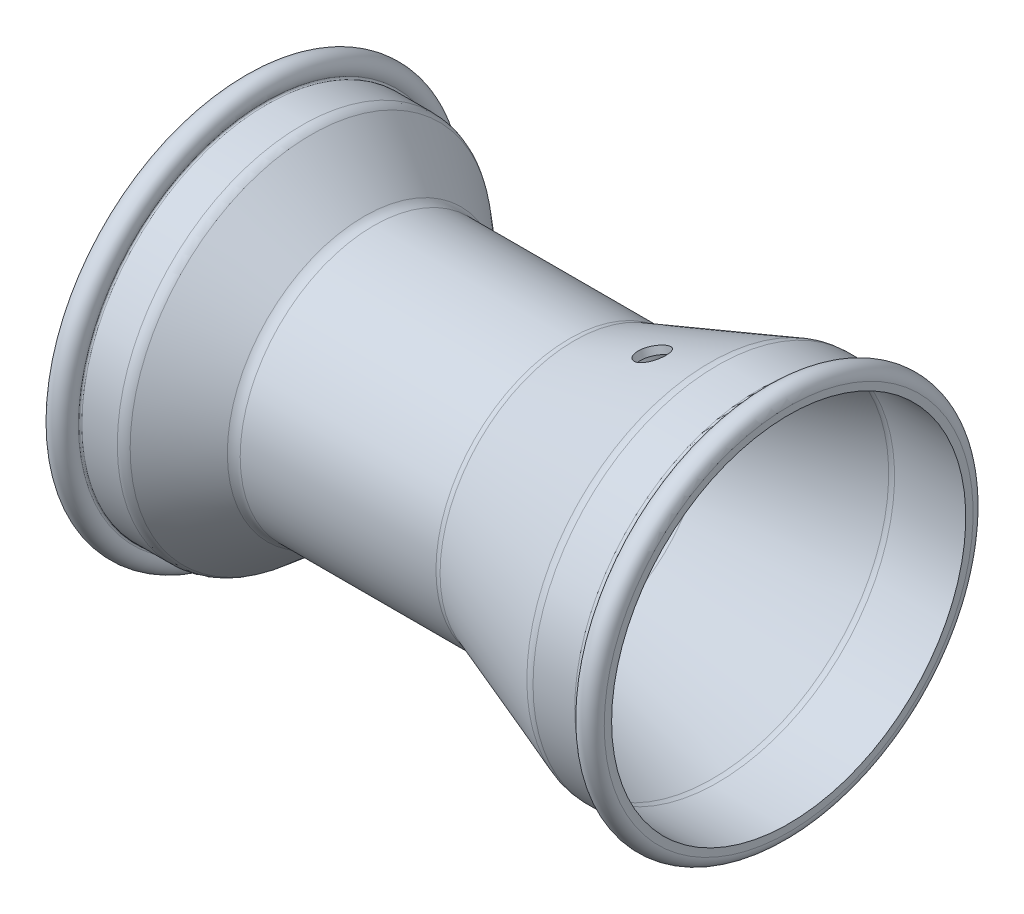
ISO-10303-21;
HEADER;
FILE_DESCRIPTION(('STEP AP214'),'2;1');
FILE_NAME('part.step','',(''),(''),'','','');
FILE_SCHEMA(('AUTOMOTIVE_DESIGN { 1 0 10303 214 1 1 1 1 }'));
ENDSEC;
DATA;
#1=APPLICATION_CONTEXT('core data for automotive mechanical design processes');
#2=APPLICATION_PROTOCOL_DEFINITION('international standard','automotive_design',2000,#1);
#3=PRODUCT_CONTEXT('',#1,'mechanical');
#4=PRODUCT('Part','Part','',(#3));
#5=PRODUCT_RELATED_PRODUCT_CATEGORY('part','',(#4));
#6=PRODUCT_DEFINITION_FORMATION('','',#4);
#7=PRODUCT_DEFINITION_CONTEXT('part definition',#1,'design');
#8=PRODUCT_DEFINITION('design','',#6,#7);
#9=PRODUCT_DEFINITION_SHAPE('','',#8);
#10=(LENGTH_UNIT() NAMED_UNIT(*) SI_UNIT(.MILLI.,.METRE.));
#11=(NAMED_UNIT(*) PLANE_ANGLE_UNIT() SI_UNIT($,.RADIAN.));
#12=(NAMED_UNIT(*) SI_UNIT($,.STERADIAN.) SOLID_ANGLE_UNIT());
#13=UNCERTAINTY_MEASURE_WITH_UNIT(LENGTH_MEASURE(1.E-05),#10,'distance_accuracy_value','');
#14=(GEOMETRIC_REPRESENTATION_CONTEXT(3) GLOBAL_UNCERTAINTY_ASSIGNED_CONTEXT((#13)) GLOBAL_UNIT_ASSIGNED_CONTEXT((#10,
#11,#12)) REPRESENTATION_CONTEXT('',''));
#15=CARTESIAN_POINT('',(0.,0.,0.));
#16=DIRECTION('',(0.,0.,1.));
#17=DIRECTION('',(1.,0.,0.));
#18=AXIS2_PLACEMENT_3D('',#15,#16,#17);
#19=CARTESIAN_POINT('',(-137.555203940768,0.,0.));
#20=DIRECTION('',(-1.,0.,0.));
#21=DIRECTION('',(0.,0.,1.));
#22=AXIS2_PLACEMENT_3D('',#19,#20,#21);
#23=TOROIDAL_SURFACE('',#22,64.9999999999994,3.99999999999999);
#24=CARTESIAN_POINT('',(-133.984388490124,0.,0.));
#25=DIRECTION('',(-1.,0.,0.));
#26=DIRECTION('',(0.,0.,1.));
#27=AXIS2_PLACEMENT_3D('',#24,#25,#26);
#28=CIRCLE('',#27,63.1974248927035);
#29=CARTESIAN_POINT('',(-133.984388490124,0.,63.1974248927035));
#30=VERTEX_POINT('',#29);
#31=EDGE_CURVE('E10',#30,#30,#28,.T.);
#32=ORIENTED_EDGE('',*,*,#31,.T.);
#33=EDGE_LOOP('',(#32));
#34=FACE_BOUND('',#33,.T.);
#35=CARTESIAN_POINT('',(-141.555203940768,0.,0.));
#36=DIRECTION('',(-1.,0.,0.));
#37=DIRECTION('',(0.,0.,1.));
#38=AXIS2_PLACEMENT_3D('',#35,#36,#37);
#39=CIRCLE('',#38,64.9999999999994);
#40=CARTESIAN_POINT('',(-141.555203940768,0.,64.9999999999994));
#41=VERTEX_POINT('',#40);
#42=EDGE_CURVE('E125',#41,#41,#39,.T.);
#43=ORIENTED_EDGE('',*,*,#42,.F.);
#44=EDGE_LOOP('',(#43));
#45=FACE_BOUND('',#44,.T.);
#46=ADVANCED_FACE('F31',(#34,#45),#23,.T.);
#47=CARTESIAN_POINT('',(-133.555203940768,0.,0.));
#48=DIRECTION('',(-1.,0.,0.));
#49=DIRECTION('',(0.,0.,1.));
#50=AXIS2_PLACEMENT_3D('',#47,#48,#49);
#51=TOROIDAL_SURFACE('',#50,62.980769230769,0.480769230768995);
#52=CARTESIAN_POINT('',(-133.555203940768,0.,0.));
#53=DIRECTION('',(-1.,0.,0.));
#54=DIRECTION('',(0.,0.,1.));
#55=AXIS2_PLACEMENT_3D('',#52,#53,#54);
#56=CIRCLE('',#55,62.5000000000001);
#57=CARTESIAN_POINT('',(-133.555203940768,0.,62.5000000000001));
#58=VERTEX_POINT('',#57);
#59=EDGE_CURVE('E37',#58,#58,#56,.T.);
#60=ORIENTED_EDGE('',*,*,#59,.T.);
#61=EDGE_LOOP('',(#60));
#62=FACE_BOUND('',#61,.T.);
#63=ORIENTED_EDGE('',*,*,#31,.F.);
#64=EDGE_LOOP('',(#63));
#65=FACE_BOUND('',#64,.T.);
#66=ADVANCED_FACE('F162',(#62,#65),#51,.F.);
#67=CARTESIAN_POINT('',(-112.,0.,0.));
#68=DIRECTION('',(-1.,0.,0.));
#69=DIRECTION('',(0.,0.,1.));
#70=AXIS2_PLACEMENT_3D('',#67,#68,#69);
#71=CYLINDRICAL_SURFACE('',#70,62.5000000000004);
#72=CARTESIAN_POINT('',(-121.555203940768,0.,0.));
#73=DIRECTION('',(-1.,0.,0.));
#74=DIRECTION('',(0.,0.,1.));
#75=AXIS2_PLACEMENT_3D('',#72,#73,#74);
#76=CIRCLE('',#75,62.5000000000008);
#77=CARTESIAN_POINT('',(-121.555203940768,0.,62.5000000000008));
#78=VERTEX_POINT('',#77);
#79=EDGE_CURVE('E41',#78,#78,#76,.T.);
#80=ORIENTED_EDGE('',*,*,#79,.T.);
#81=EDGE_LOOP('',(#80));
#82=FACE_BOUND('',#81,.T.);
#83=ORIENTED_EDGE('',*,*,#59,.F.);
#84=EDGE_LOOP('',(#83));
#85=FACE_BOUND('',#84,.T.);
#86=ADVANCED_FACE('F166',(#82,#85),#71,.T.);
#87=CARTESIAN_POINT('',(-121.555203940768,0.,0.));
#88=DIRECTION('',(-1.,0.,0.));
#89=DIRECTION('',(0.,0.,1.));
#90=AXIS2_PLACEMENT_3D('',#87,#88,#89);
#91=TOROIDAL_SURFACE('',#90,57.5,5.00000000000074);
#92=ORIENTED_EDGE('',*,*,#79,.F.);
#93=EDGE_LOOP('',(#92));
#94=FACE_BOUND('',#93,.T.);
#95=CARTESIAN_POINT('',(-118.354347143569,0.,0.));
#96=DIRECTION('',(-1.,0.,0.));
#97=DIRECTION('',(0.,0.,1.));
#98=AXIS2_PLACEMENT_3D('',#95,#96,#97);
#99=CIRCLE('',#98,61.3411607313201);
#100=CARTESIAN_POINT('',(-118.354347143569,0.,61.3411607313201));
#101=VERTEX_POINT('',#100);
#102=EDGE_CURVE('E45',#101,#101,#99,.T.);
#103=ORIENTED_EDGE('',*,*,#102,.T.);
#104=EDGE_LOOP('',(#103));
#105=FACE_BOUND('',#104,.T.);
#106=ADVANCED_FACE('F278',(#94,#105),#91,.T.);
#107=CARTESIAN_POINT('',(-118.354347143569,0.,0.));
#108=DIRECTION('',(-1.,0.,0.));
#109=DIRECTION('',(0.,0.,1.));
#110=AXIS2_PLACEMENT_3D('',#107,#108,#109);
#111=CONICAL_SURFACE('',#110,61.3411607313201,0.694721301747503);
#112=CARTESIAN_POINT('',(-100.393368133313,0.,0.));
#113=DIRECTION('',(-1.,0.,0.));
#114=DIRECTION('',(0.,0.,1.));
#115=AXIS2_PLACEMENT_3D('',#112,#113,#114);
#116=CIRCLE('',#115,46.374194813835);
#117=CARTESIAN_POINT('',(-100.393368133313,0.,46.374194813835));
#118=VERTEX_POINT('',#117);
#119=EDGE_CURVE('E50',#118,#118,#116,.T.);
#120=ORIENTED_EDGE('',*,*,#119,.T.);
#121=EDGE_LOOP('',(#120));
#122=FACE_BOUND('',#121,.T.);
#123=ORIENTED_EDGE('',*,*,#102,.F.);
#124=EDGE_LOOP('',(#123));
#125=FACE_BOUND('',#124,.T.);
#126=ADVANCED_FACE('F274',(#122,#125),#111,.T.);
#127=CARTESIAN_POINT('',(-97.1925113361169,0.,0.));
#128=DIRECTION('',(-1.,0.,0.));
#129=DIRECTION('',(0.,0.,1.));
#130=AXIS2_PLACEMENT_3D('',#127,#128,#129);
#131=TOROIDAL_SURFACE('',#130,50.2153555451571,5.00000000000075);
#132=ORIENTED_EDGE('',*,*,#119,.F.);
#133=EDGE_LOOP('',(#132));
#134=FACE_BOUND('',#133,.T.);
#135=CARTESIAN_POINT('',(-97.1925113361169,0.,0.));
#136=DIRECTION('',(-1.,0.,0.));
#137=DIRECTION('',(0.,0.,1.));
#138=AXIS2_PLACEMENT_3D('',#135,#136,#137);
#139=CIRCLE('',#138,45.2153555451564);
#140=CARTESIAN_POINT('',(-97.1925113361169,0.,45.2153555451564));
#141=VERTEX_POINT('',#140);
#142=EDGE_CURVE('E53',#141,#141,#139,.T.);
#143=ORIENTED_EDGE('',*,*,#142,.T.);
#144=EDGE_LOOP('',(#143));
#145=FACE_BOUND('',#144,.T.);
#146=ADVANCED_FACE('F270',(#134,#145),#131,.F.);
#147=CARTESIAN_POINT('',(-112.,0.,0.));
#148=DIRECTION('',(-1.,0.,0.));
#149=DIRECTION('',(0.,0.,1.));
#150=AXIS2_PLACEMENT_3D('',#147,#148,#149);
#151=CYLINDRICAL_SURFACE('',#150,45.2153555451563);
#152=CARTESIAN_POINT('',(-30.8644186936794,0.,0.));
#153=DIRECTION('',(-1.,0.,0.));
#154=DIRECTION('',(0.,0.,1.));
#155=AXIS2_PLACEMENT_3D('',#152,#153,#154);
#156=CIRCLE('',#155,45.2153555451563);
#157=CARTESIAN_POINT('',(-30.8644186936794,0.,45.2153555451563));
#158=VERTEX_POINT('',#157);
#159=EDGE_CURVE('E56',#158,#158,#156,.T.);
#160=ORIENTED_EDGE('',*,*,#159,.T.);
#161=EDGE_LOOP('',(#160));
#162=FACE_BOUND('',#161,.T.);
#163=ORIENTED_EDGE('',*,*,#142,.F.);
#164=EDGE_LOOP('',(#163));
#165=FACE_BOUND('',#164,.T.);
#166=ADVANCED_FACE('F266',(#162,#165),#151,.T.);
#167=CARTESIAN_POINT('',(-30.8644186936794,0.,0.));
#168=DIRECTION('',(-1.,0.,0.));
#169=DIRECTION('',(0.,0.,1.));
#170=AXIS2_PLACEMENT_3D('',#167,#168,#169);
#171=TOROIDAL_SURFACE('',#170,50.2153555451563,5.);
#172=ORIENTED_EDGE('',*,*,#159,.F.);
#173=EDGE_LOOP('',(#172));
#174=FACE_BOUND('',#173,.T.);
#175=CARTESIAN_POINT('',(-29.1704183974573,0.,0.));
#176=DIRECTION('',(-1.,0.,0.));
#177=DIRECTION('',(0.,0.,1.));
#178=AXIS2_PLACEMENT_3D('',#175,#176,#177);
#179=CIRCLE('',#178,45.5110635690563);
#180=CARTESIAN_POINT('',(-29.1704183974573,0.,45.5110635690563));
#181=VERTEX_POINT('',#180);
#182=EDGE_CURVE('E59',#181,#181,#179,.T.);
#183=ORIENTED_EDGE('',*,*,#182,.T.);
#184=EDGE_LOOP('',(#183));
#185=FACE_BOUND('',#184,.T.);
#186=ADVANCED_FACE('F262',(#174,#185),#171,.F.);
#187=CARTESIAN_POINT('',(-29.1704183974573,0.,0.));
#188=DIRECTION('',(1.,0.,0.));
#189=DIRECTION('',(0.,0.,-1.));
#190=AXIS2_PLACEMENT_3D('',#187,#188,#189);
#191=CONICAL_SURFACE('',#190,45.5110635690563,0.345641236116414);
#192=CARTESIAN_POINT('',(-5.79435645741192,53.7909875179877,-3.85164620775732));
#193=CARTESIAN_POINT('',(-5.69068395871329,53.8220108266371,-3.94108863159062));
#194=CARTESIAN_POINT('',(-5.58351659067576,53.8544114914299,-4.02597082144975));
#195=CARTESIAN_POINT('',(-5.3629256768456,53.9218769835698,-4.18607123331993));
#196=CARTESIAN_POINT('',(-5.24950062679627,53.9569424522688,-4.26128711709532));
#197=CARTESIAN_POINT('',(-5.0171707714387,54.0296210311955,-4.40154326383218));
#198=CARTESIAN_POINT('',(-4.89826162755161,54.0672361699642,-4.46657528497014));
#199=CARTESIAN_POINT('',(-4.65587719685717,54.1448366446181,-4.58594961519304));
#200=CARTESIAN_POINT('',(-4.53240027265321,54.1848228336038,-4.64028804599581));
#201=CARTESIAN_POINT('',(-4.28191086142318,54.2669259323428,-4.73782113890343));
#202=CARTESIAN_POINT('',(-4.15490078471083,54.3090414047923,-4.78102320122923));
#203=CARTESIAN_POINT('',(-3.89814520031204,54.3952110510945,-4.85603244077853));
#204=CARTESIAN_POINT('',(-3.76839870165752,54.4392659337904,-4.88783541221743));
#205=CARTESIAN_POINT('',(-3.50723835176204,54.5290061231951,-4.93977706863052));
#206=CARTESIAN_POINT('',(-3.37582556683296,54.5746904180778,-4.9599228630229));
#207=CARTESIAN_POINT('',(-3.11215451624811,54.6674335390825,-4.98843889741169));
#208=CARTESIAN_POINT('',(-2.97989595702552,54.7144928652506,-4.99680479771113));
#209=CARTESIAN_POINT('',(-2.71587942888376,54.8095146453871,-5.00167985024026));
#210=CARTESIAN_POINT('',(-2.58412105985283,54.8574743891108,-4.99822022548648));
#211=CARTESIAN_POINT('',(-2.32163929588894,54.9540803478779,-4.97953523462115));
#212=CARTESIAN_POINT('',(-2.19091630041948,55.0027268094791,-4.96430553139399));
#213=CARTESIAN_POINT('',(-1.93151583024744,55.1002932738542,-4.9221930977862));
#214=CARTESIAN_POINT('',(-1.80283768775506,55.1492131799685,-4.89531425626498));
#215=CARTESIAN_POINT('',(-1.54832919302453,55.2469620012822,-4.83008713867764));
#216=CARTESIAN_POINT('',(-1.42249991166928,55.2957908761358,-4.79173462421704));
#217=CARTESIAN_POINT('',(-1.17466264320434,55.3929024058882,-4.70386059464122));
#218=CARTESIAN_POINT('',(-1.05265286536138,55.4411853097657,-4.65434440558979));
#219=CARTESIAN_POINT('',(-0.813179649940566,55.5368219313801,-4.54446974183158));
#220=CARTESIAN_POINT('',(-0.69571790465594,55.5841753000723,-4.48410727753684));
#221=CARTESIAN_POINT('',(-0.466212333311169,55.6774933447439,-4.35299572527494));
#222=CARTESIAN_POINT('',(-0.354166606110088,55.7234585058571,-4.28225031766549));
#223=CARTESIAN_POINT('',(-0.13618568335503,55.8135946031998,-4.13086665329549));
#224=CARTESIAN_POINT('',(-0.0302527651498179,55.8577648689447,-4.05022474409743));
#225=CARTESIAN_POINT('',(0.277850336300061,55.9871781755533,-3.79378534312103));
#226=CARTESIAN_POINT('',(0.469847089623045,56.0691284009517,-3.60374775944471));
#227=CARTESIAN_POINT('',(0.821111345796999,56.220795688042,-3.19148780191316));
#228=CARTESIAN_POINT('',(0.980378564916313,56.2905126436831,-2.96926514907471));
#229=CARTESIAN_POINT('',(1.26236513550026,56.4150165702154,-2.49841859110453));
#230=CARTESIAN_POINT('',(1.38502835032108,56.4697805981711,-2.2497549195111));
#231=CARTESIAN_POINT('',(1.59019170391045,56.5619008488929,-1.73337409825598));
#232=CARTESIAN_POINT('',(1.67269241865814,56.5992573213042,-1.46565722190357));
#233=CARTESIAN_POINT('',(1.79520934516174,56.654885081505,-0.919405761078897));
#234=CARTESIAN_POINT('',(1.83532153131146,56.6731994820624,-0.640897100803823));
#235=CARTESIAN_POINT('',(1.87232077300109,56.6900890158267,-0.0804341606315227));
#236=CARTESIAN_POINT('',(1.86920859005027,56.6886644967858,0.201520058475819));
#237=CARTESIAN_POINT('',(1.81990835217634,56.6661691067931,0.760111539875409));
#238=CARTESIAN_POINT('',(1.7738300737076,56.6451483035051,1.03676051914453));
#239=CARTESIAN_POINT('',(1.63997564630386,56.5844469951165,1.57764334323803));
#240=CARTESIAN_POINT('',(1.55219922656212,56.5447663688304,1.84187710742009));
#241=CARTESIAN_POINT('',(1.33715241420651,56.4483964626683,2.35073630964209));
#242=CARTESIAN_POINT('',(1.20984283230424,56.3916903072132,2.59534198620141));
#243=CARTESIAN_POINT('',(0.919094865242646,56.2636564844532,3.05779220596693));
#244=CARTESIAN_POINT('',(0.755655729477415,56.1923285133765,3.27563619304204));
#245=CARTESIAN_POINT('',(0.396374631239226,56.037707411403,3.67908058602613));
#246=CARTESIAN_POINT('',(0.200435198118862,55.9543783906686,3.86458044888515));
#247=CARTESIAN_POINT('',(-0.218309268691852,55.7791942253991,4.19728164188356));
#248=CARTESIAN_POINT('',(-0.44111440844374,55.6873390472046,4.34448282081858));
#249=CARTESIAN_POINT('',(-0.907737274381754,55.4985062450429,4.59646026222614));
#250=CARTESIAN_POINT('',(-1.15156544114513,55.4015260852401,4.7012152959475));
#251=CARTESIAN_POINT('',(-1.6534682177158,55.2059384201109,4.86517197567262));
#252=CARTESIAN_POINT('',(-1.91154252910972,55.107330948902,4.92437457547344));
#253=CARTESIAN_POINT('',(-2.43395982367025,54.9120437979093,4.99539820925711));
#254=CARTESIAN_POINT('',(-2.69828209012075,54.8153592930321,5.00735837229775));
#255=CARTESIAN_POINT('',(-3.22644244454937,54.6265184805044,4.98393014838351));
#256=CARTESIAN_POINT('',(-3.49028053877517,54.5343621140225,4.94854237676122));
#257=CARTESIAN_POINT('',(-4.00938477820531,54.3571879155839,4.83156092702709));
#258=CARTESIAN_POINT('',(-4.26466660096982,54.2721565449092,4.7500572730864));
#259=CARTESIAN_POINT('',(-4.75981396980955,54.1109324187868,4.54325706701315));
#260=CARTESIAN_POINT('',(-4.99967929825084,54.0347397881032,4.41795989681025));
#261=CARTESIAN_POINT('',(-5.45749308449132,53.8924166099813,4.12680750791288));
#262=CARTESIAN_POINT('',(-5.67539322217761,53.8263080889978,3.96086551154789));
#263=CARTESIAN_POINT('',(-6.08222648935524,53.7052689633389,3.59329393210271));
#264=CARTESIAN_POINT('',(-6.27115897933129,53.6503386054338,3.39166356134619));
#265=CARTESIAN_POINT('',(-6.6149765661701,53.5520230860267,2.95755036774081));
#266=CARTESIAN_POINT('',(-6.76975998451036,53.5086723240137,2.72497862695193));
#267=CARTESIAN_POINT('',(-6.97216389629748,53.4527094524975,2.35861371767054));
#268=CARTESIAN_POINT('',(-7.03469553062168,53.435558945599,2.2335024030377));
#269=CARTESIAN_POINT('',(-7.14939853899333,53.4042835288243,1.97826868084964));
#270=CARTESIAN_POINT('',(-7.20157377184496,53.3901574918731,1.84814816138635));
#271=CARTESIAN_POINT('',(-7.2951221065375,53.3649489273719,1.58389762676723));
#272=CARTESIAN_POINT('',(-7.33650200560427,53.353864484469,1.44977019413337));
#273=CARTESIAN_POINT('',(-7.40817035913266,53.3347333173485,1.17842314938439));
#274=CARTESIAN_POINT('',(-7.43846294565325,53.3266854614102,1.04120470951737));
#275=CARTESIAN_POINT('',(-7.48774254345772,53.3136220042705,0.764566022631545));
#276=CARTESIAN_POINT('',(-7.50672598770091,53.3086073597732,0.625145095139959));
#277=CARTESIAN_POINT('',(-7.53321593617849,53.3016159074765,0.345193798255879));
#278=CARTESIAN_POINT('',(-7.54072672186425,53.2996379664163,0.204663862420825));
#279=CARTESIAN_POINT('',(-7.54421889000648,53.2987178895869,-0.076101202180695));
#280=CARTESIAN_POINT('',(-7.54023690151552,53.2997661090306,-0.216335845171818));
#281=CARTESIAN_POINT('',(-7.52085784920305,53.3048766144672,-0.495906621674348));
#282=CARTESIAN_POINT('',(-7.50546501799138,53.308937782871,-0.635243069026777));
#283=CARTESIAN_POINT('',(-7.46337905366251,53.3200759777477,-0.912161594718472));
#284=CARTESIAN_POINT('',(-7.43667919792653,53.3271547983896,-1.04974257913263));
#285=CARTESIAN_POINT('',(-7.3722019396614,53.3443241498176,-1.32203833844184));
#286=CARTESIAN_POINT('',(-7.33442859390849,53.3544135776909,-1.45675414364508));
#287=CARTESIAN_POINT('',(-7.24807801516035,53.377606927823,-1.72247987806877));
#288=CARTESIAN_POINT('',(-7.19949581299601,53.3907122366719,-1.853488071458));
#289=CARTESIAN_POINT('',(-7.09193745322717,53.4199216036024,-2.11076214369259));
#290=CARTESIAN_POINT('',(-7.0329650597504,53.4360245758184,-2.23702971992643));
#291=CARTESIAN_POINT('',(-6.9051188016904,53.4712051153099,-2.48389080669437));
#292=CARTESIAN_POINT('',(-6.83625275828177,53.4902803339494,-2.60448870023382));
#293=CARTESIAN_POINT('',(-6.68913995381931,53.5313833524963,-2.83923256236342));
#294=CARTESIAN_POINT('',(-6.61089560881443,53.5534103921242,-2.95338018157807));
#295=CARTESIAN_POINT('',(-6.42003266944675,53.6076531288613,-3.20865374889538));
#296=CARTESIAN_POINT('',(-6.30426250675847,53.6409141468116,-3.34721948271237));
#297=CARTESIAN_POINT('',(-6.05909938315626,53.7123300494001,-3.61032984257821));
#298=CARTESIAN_POINT('',(-5.92970636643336,53.7504849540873,-3.73487441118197));
#299=CARTESIAN_POINT('',(-5.79435645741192,53.7909875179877,-3.85164620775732));
#300=B_SPLINE_CURVE_WITH_KNOTS('',3,(#192,#193,#194,#195,#196,#197,#198,#199,#200,#201,#202,
#203,#204,#205,#206,#207,#208,#209,#210,#211,#212,#213,#214,#215,#216,#217,#218,#219,#220,#221,
#222,#223,#224,#225,#226,#227,#228,#229,#230,#231,#232,#233,#234,#235,#236,#237,#238,#239,#240,
#241,#242,#243,#244,#245,#246,#247,#248,#249,#250,#251,#252,#253,#254,#255,#256,#257,#258,#259,
#260,#261,#262,#263,#264,#265,#266,#267,#268,#269,#270,#271,#272,#273,#274,#275,#276,#277,#278,
#279,#280,#281,#282,#283,#284,#285,#286,#287,#288,#289,#290,#291,#292,#293,#294,#295,#296,#297,
#298,#299),.UNSPECIFIED.,.T.,.F.,(4,2,2,2,2,2,2,2,2,2,2,2,2,2,2,2,2,2,2,2,2,2,2,2,2,2,2,2,2,2,2,
2,2,2,2,2,2,2,2,2,2,2,2,2,2,2,2,2,2,2,2,2,2,4),(0.,0.421022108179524,0.842145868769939,
1.26360870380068,1.68522411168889,2.10655862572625,2.52804843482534,2.94928091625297,
3.37066853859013,3.79094442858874,4.21137525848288,4.63166584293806,5.05211187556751,
5.47235774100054,5.89275850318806,6.31301060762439,6.73341828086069,7.57596422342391,
8.41851746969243,9.26235630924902,10.1061830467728,10.94809510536,11.7899923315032,
12.6297444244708,13.4695019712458,14.3100946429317,15.1507047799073,15.9938831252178,
16.8370647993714,17.6806676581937,18.5242528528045,19.3653518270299,20.20643987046,
21.045891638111,21.885355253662,22.7266270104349,23.5679173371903,24.4116797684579,
24.8340141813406,25.2561909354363,25.6781012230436,26.0998541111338,26.5217399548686,
26.9434683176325,27.3638540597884,27.7840839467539,28.2045640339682,28.6248902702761,
29.0454101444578,29.4657779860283,29.8858153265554,30.3057446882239,30.8554089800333,
31.4050755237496),.UNSPECIFIED.);
#301=CARTESIAN_POINT('',(-5.79435645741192,53.7909875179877,-3.85164620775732));
#302=VERTEX_POINT('',#301);
#303=EDGE_CURVE('E128',#302,#302,#300,.T.);
#304=ORIENTED_EDGE('',*,*,#303,.T.);
#305=EDGE_LOOP('',(#304));
#306=FACE_BOUND('',#305,.T.);
#307=CARTESIAN_POINT('',(16.7766054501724,0.,0.));
#308=DIRECTION('',(-1.,0.,0.));
#309=DIRECTION('',(0.,0.,1.));
#310=AXIS2_PLACEMENT_3D('',#307,#308,#309);
#311=CIRCLE('',#310,62.0564379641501);
#312=CARTESIAN_POINT('',(16.7766054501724,0.,62.0564379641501));
#313=VERTEX_POINT('',#312);
#314=EDGE_CURVE('E62',#313,#313,#311,.T.);
#315=ORIENTED_EDGE('',*,*,#314,.T.);
#316=EDGE_LOOP('',(#315));
#317=FACE_BOUND('',#316,.T.);
#318=ORIENTED_EDGE('',*,*,#182,.F.);
#319=EDGE_LOOP('',(#318));
#320=FACE_BOUND('',#319,.T.);
#321=ADVANCED_FACE('F258',(#306,#317,#320),#191,.T.);
#322=CARTESIAN_POINT('',(19.3176058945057,0.,0.));
#323=DIRECTION('',(-1.,0.,0.));
#324=DIRECTION('',(0.,0.,1.));
#325=AXIS2_PLACEMENT_3D('',#322,#323,#324);
#326=TOROIDAL_SURFACE('',#325,55.,7.5);
#327=ORIENTED_EDGE('',*,*,#314,.F.);
#328=EDGE_LOOP('',(#327));
#329=FACE_BOUND('',#328,.T.);
#330=CARTESIAN_POINT('',(19.3176058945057,0.,0.));
#331=DIRECTION('',(-1.,0.,0.));
#332=DIRECTION('',(0.,0.,1.));
#333=AXIS2_PLACEMENT_3D('',#330,#331,#332);
#334=CIRCLE('',#333,62.5);
#335=CARTESIAN_POINT('',(19.3176058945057,0.,62.5));
#336=VERTEX_POINT('',#335);
#337=EDGE_CURVE('E65',#336,#336,#334,.T.);
#338=ORIENTED_EDGE('',*,*,#337,.T.);
#339=EDGE_LOOP('',(#338));
#340=FACE_BOUND('',#339,.T.);
#341=ADVANCED_FACE('F254',(#329,#340),#326,.T.);
#342=CARTESIAN_POINT('',(-112.,0.,0.));
#343=DIRECTION('',(-1.,0.,0.));
#344=DIRECTION('',(0.,0.,1.));
#345=AXIS2_PLACEMENT_3D('',#342,#343,#344);
#346=CYLINDRICAL_SURFACE('',#345,62.5);
#347=ORIENTED_EDGE('',*,*,#337,.F.);
#348=EDGE_LOOP('',(#347));
#349=FACE_BOUND('',#348,.T.);
#350=CARTESIAN_POINT('',(33.4447960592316,0.,0.));
#351=DIRECTION('',(-1.,0.,0.));
#352=DIRECTION('',(0.,0.,1.));
#353=AXIS2_PLACEMENT_3D('',#350,#351,#352);
#354=CIRCLE('',#353,62.5);
#355=CARTESIAN_POINT('',(33.4447960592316,0.,62.5));
#356=VERTEX_POINT('',#355);
#357=EDGE_CURVE('E68',#356,#356,#354,.T.);
#358=ORIENTED_EDGE('',*,*,#357,.T.);
#359=EDGE_LOOP('',(#358));
#360=FACE_BOUND('',#359,.T.);
#361=ADVANCED_FACE('F250',(#349,#360),#346,.T.);
#362=CARTESIAN_POINT('',(33.4447960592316,0.,0.));
#363=DIRECTION('',(-1.,0.,0.));
#364=DIRECTION('',(0.,0.,1.));
#365=AXIS2_PLACEMENT_3D('',#362,#363,#364);
#366=TOROIDAL_SURFACE('',#365,65.,2.5);
#367=ORIENTED_EDGE('',*,*,#357,.F.);
#368=EDGE_LOOP('',(#367));
#369=FACE_BOUND('',#368,.T.);
#370=CARTESIAN_POINT('',(35.7524883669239,0.,0.));
#371=DIRECTION('',(-1.,0.,0.));
#372=DIRECTION('',(0.,0.,1.));
#373=AXIS2_PLACEMENT_3D('',#370,#371,#372);
#374=CIRCLE('',#373,64.0384615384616);
#375=CARTESIAN_POINT('',(35.7524883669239,0.,64.0384615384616));
#376=VERTEX_POINT('',#375);
#377=EDGE_CURVE('E71',#376,#376,#374,.T.);
#378=ORIENTED_EDGE('',*,*,#377,.T.);
#379=EDGE_LOOP('',(#378));
#380=FACE_BOUND('',#379,.T.);
#381=ADVANCED_FACE('F246',(#369,#380),#366,.F.);
#382=CARTESIAN_POINT('',(39.4447960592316,0.,0.));
#383=DIRECTION('',(-1.,0.,0.));
#384=DIRECTION('',(0.,0.,1.));
#385=AXIS2_PLACEMENT_3D('',#382,#383,#384);
#386=TOROIDAL_SURFACE('',#385,62.5,4.);
#387=ORIENTED_EDGE('',*,*,#377,.F.);
#388=EDGE_LOOP('',(#387));
#389=FACE_BOUND('',#388,.T.);
#390=CARTESIAN_POINT('',(43.4447960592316,0.,0.));
#391=DIRECTION('',(-1.,0.,0.));
#392=DIRECTION('',(0.,0.,1.));
#393=AXIS2_PLACEMENT_3D('',#390,#391,#392);
#394=CIRCLE('',#393,62.5);
#395=CARTESIAN_POINT('',(43.4447960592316,0.,62.5));
#396=VERTEX_POINT('',#395);
#397=EDGE_CURVE('E74',#396,#396,#394,.T.);
#398=ORIENTED_EDGE('',*,*,#397,.T.);
#399=EDGE_LOOP('',(#398));
#400=FACE_BOUND('',#399,.T.);
#401=ADVANCED_FACE('F242',(#389,#400),#386,.T.);
#402=CARTESIAN_POINT('',(43.4447960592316,60.9999999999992,0.));
#403=DIRECTION('',(1.,0.,0.));
#404=DIRECTION('',(0.,0.,-1.));
#405=AXIS2_PLACEMENT_3D('',#402,#403,#404);
#406=PLANE('',#405);
#407=CARTESIAN_POINT('',(43.4447960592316,0.,0.));
#408=DIRECTION('',(-1.,0.,0.));
#409=DIRECTION('',(0.,0.,1.));
#410=AXIS2_PLACEMENT_3D('',#407,#408,#409);
#411=CIRCLE('',#410,60.);
#412=CARTESIAN_POINT('',(43.4447960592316,0.,60.));
#413=VERTEX_POINT('',#412);
#414=EDGE_CURVE('E77',#413,#413,#411,.T.);
#415=ORIENTED_EDGE('',*,*,#414,.T.);
#416=EDGE_LOOP('',(#415));
#417=FACE_BOUND('',#416,.T.);
#418=ORIENTED_EDGE('',*,*,#397,.F.);
#419=EDGE_LOOP('',(#418));
#420=FACE_BOUND('',#419,.T.);
#421=ADVANCED_FACE('F238',(#417,#420),#406,.T.);
#422=CARTESIAN_POINT('',(-112.,0.,0.));
#423=DIRECTION('',(-1.,0.,0.));
#424=DIRECTION('',(0.,0.,1.));
#425=AXIS2_PLACEMENT_3D('',#422,#423,#424);
#426=CYLINDRICAL_SURFACE('',#425,60.);
#427=CARTESIAN_POINT('',(19.3176058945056,0.,0.));
#428=DIRECTION('',(-1.,0.,0.));
#429=DIRECTION('',(0.,0.,1.));
#430=AXIS2_PLACEMENT_3D('',#427,#428,#429);
#431=CIRCLE('',#430,60.);
#432=CARTESIAN_POINT('',(19.3176058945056,0.,60.));
#433=VERTEX_POINT('',#432);
#434=EDGE_CURVE('E80',#433,#433,#431,.T.);
#435=ORIENTED_EDGE('',*,*,#434,.T.);
#436=EDGE_LOOP('',(#435));
#437=FACE_BOUND('',#436,.T.);
#438=ORIENTED_EDGE('',*,*,#414,.F.);
#439=EDGE_LOOP('',(#438));
#440=FACE_BOUND('',#439,.T.);
#441=ADVANCED_FACE('F234',(#437,#440),#426,.F.);
#442=CARTESIAN_POINT('',(19.3176058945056,0.,0.));
#443=DIRECTION('',(-1.,0.,0.));
#444=DIRECTION('',(0.,0.,1.));
#445=AXIS2_PLACEMENT_3D('',#442,#443,#444);
#446=TOROIDAL_SURFACE('',#445,55.,5.);
#447=ORIENTED_EDGE('',*,*,#434,.F.);
#448=EDGE_LOOP('',(#447));
#449=FACE_BOUND('',#448,.T.);
#450=CARTESIAN_POINT('',(17.6236055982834,0.,0.));
#451=DIRECTION('',(-1.,0.,0.));
#452=DIRECTION('',(0.,0.,1.));
#453=AXIS2_PLACEMENT_3D('',#450,#451,#452);
#454=CIRCLE('',#453,59.7042919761);
#455=CARTESIAN_POINT('',(17.6236055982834,0.,59.7042919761));
#456=VERTEX_POINT('',#455);
#457=EDGE_CURVE('E83',#456,#456,#454,.T.);
#458=ORIENTED_EDGE('',*,*,#457,.T.);
#459=EDGE_LOOP('',(#458));
#460=FACE_BOUND('',#459,.T.);
#461=ADVANCED_FACE('F230',(#449,#460),#446,.F.);
#462=CARTESIAN_POINT('',(-28.3234182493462,0.,0.));
#463=DIRECTION('',(1.,0.,0.));
#464=DIRECTION('',(0.,0.,-1.));
#465=AXIS2_PLACEMENT_3D('',#462,#463,#464);
#466=CONICAL_SURFACE('',#465,43.1589175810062,0.345641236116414);
#467=CARTESIAN_POINT('',(-5.47804825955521,51.2783343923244,-3.31633129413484));
#468=CARTESIAN_POINT('',(-5.38825980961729,51.3039368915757,-3.42143978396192));
#469=CARTESIAN_POINT('',(-5.29429820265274,51.3309882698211,-3.52260367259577));
#470=CARTESIAN_POINT('',(-5.09868506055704,51.3879453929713,-3.71639563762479));
#471=CARTESIAN_POINT('',(-4.99703165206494,51.4178518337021,-3.80902162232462));
#472=CARTESIAN_POINT('',(-4.78673768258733,51.4804565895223,-3.98511730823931));
#473=CARTESIAN_POINT('',(-4.67809145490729,51.5131571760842,-4.06857943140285));
#474=CARTESIAN_POINT('',(-4.4546541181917,51.5812355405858,-4.22569871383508));
#475=CARTESIAN_POINT('',(-4.33986078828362,51.6166142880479,-4.29935229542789));
#476=CARTESIAN_POINT('',(-4.1050981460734,51.6898776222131,-4.43624474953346));
#477=CARTESIAN_POINT('',(-3.98513241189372,51.7277604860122,-4.49949068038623));
#478=CARTESIAN_POINT('',(-3.74079207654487,51.8059008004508,-4.61519580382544));
#479=CARTESIAN_POINT('',(-3.61641586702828,51.8461591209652,-4.66765101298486));
#480=CARTESIAN_POINT('',(-3.36428934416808,51.9288107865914,-4.7613367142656));
#481=CARTESIAN_POINT('',(-3.2365411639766,51.9712027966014,-4.80257412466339));
#482=CARTESIAN_POINT('',(-2.97848360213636,52.0579250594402,-4.87358041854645));
#483=CARTESIAN_POINT('',(-2.84817329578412,52.1022560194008,-4.90334507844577));
#484=CARTESIAN_POINT('',(-2.586354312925,52.1924439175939,-4.95109977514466));
#485=CARTESIAN_POINT('',(-2.45485002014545,52.2382962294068,-4.96912258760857));
#486=CARTESIAN_POINT('',(-2.19118192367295,52.3313592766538,-4.99339958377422));
#487=CARTESIAN_POINT('',(-2.05901789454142,52.378570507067,-4.9996494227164));
#488=CARTESIAN_POINT('',(-1.79506965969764,52.4739845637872,-5.00032176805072));
#489=CARTESIAN_POINT('',(-1.66328533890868,52.5221870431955,-4.99474834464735));
#490=CARTESIAN_POINT('',(-1.40093644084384,52.6192549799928,-4.97181945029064));
#491=CARTESIAN_POINT('',(-1.27037233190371,52.6681206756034,-4.95445962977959));
#492=CARTESIAN_POINT('',(-1.0117590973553,52.7659859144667,-4.90813891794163));
#493=CARTESIAN_POINT('',(-0.883704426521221,52.8149848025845,-4.8792076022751));
#494=CARTESIAN_POINT('',(-0.630611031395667,52.9128523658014,-4.809943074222));
#495=CARTESIAN_POINT('',(-0.50557343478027,52.9617209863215,-4.76960566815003));
#496=CARTESIAN_POINT('',(-0.259453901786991,53.0588768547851,-4.67783197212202));
#497=CARTESIAN_POINT('',(-0.138370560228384,53.1071643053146,-4.62639967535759));
#498=CARTESIAN_POINT('',(0.0990781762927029,53.202749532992,-4.51280574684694));
#499=CARTESIAN_POINT('',(0.215441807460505,53.2500469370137,-4.45064014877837));
#500=CARTESIAN_POINT('',(0.556692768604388,53.3899794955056,-4.2483882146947));
#501=CARTESIAN_POINT('',(0.773429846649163,53.4805319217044,-4.09266281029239));
#502=CARTESIAN_POINT('',(1.17882891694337,53.6523915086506,-3.74422663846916));
#503=CARTESIAN_POINT('',(1.36749037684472,53.7336984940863,-3.55151516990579));
#504=CARTESIAN_POINT('',(1.71250015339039,53.8841257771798,-3.13378116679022));
#505=CARTESIAN_POINT('',(1.86874600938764,53.9532073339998,-2.90865987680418));
#506=CARTESIAN_POINT('',(2.14403067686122,54.0759792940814,-2.43292376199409));
#507=CARTESIAN_POINT('',(2.26306963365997,54.1296697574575,-2.18230903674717));
#508=CARTESIAN_POINT('',(2.46074012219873,54.2193274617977,-1.66286452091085));
#509=CARTESIAN_POINT('',(2.53940176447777,54.2553079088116,-1.39404847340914));
#510=CARTESIAN_POINT('',(2.65435943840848,54.3080249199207,-0.845686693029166));
#511=CARTESIAN_POINT('',(2.69065644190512,54.3247619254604,-0.566141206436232));
#512=CARTESIAN_POINT('',(2.71987116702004,54.3382266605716,-0.00525218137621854));
#513=CARTESIAN_POINT('',(2.71293301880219,54.3350208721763,0.276082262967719));
#514=CARTESIAN_POINT('',(2.65619986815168,54.308898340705,0.833462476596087));
#515=CARTESIAN_POINT('',(2.60640512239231,54.2859817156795,1.10950827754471));
#516=CARTESIAN_POINT('',(2.46534025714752,54.2214759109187,1.64824169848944));
#517=CARTESIAN_POINT('',(2.37410661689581,54.1799031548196,1.91094084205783));
#518=CARTESIAN_POINT('',(2.15256863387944,54.0798858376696,2.41585386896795));
#519=CARTESIAN_POINT('',(2.02226354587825,54.0214409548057,2.65806736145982));
#520=CARTESIAN_POINT('',(1.72555040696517,53.8899503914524,3.11589204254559));
#521=CARTESIAN_POINT('',(1.55903943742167,53.8168631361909,3.33142458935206));
#522=CARTESIAN_POINT('',(1.19448972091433,53.6591889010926,3.7290264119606));
#523=CARTESIAN_POINT('',(0.996450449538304,53.5746017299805,3.91109513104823));
#524=CARTESIAN_POINT('',(0.573557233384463,53.3970546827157,4.23702454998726));
#525=CARTESIAN_POINT('',(0.348641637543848,53.304075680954,4.38079486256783));
#526=CARTESIAN_POINT('',(-0.121601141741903,53.1134328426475,4.6254573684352));
#527=CARTESIAN_POINT('',(-0.366928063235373,53.0157690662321,4.72635011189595));
#528=CARTESIAN_POINT('',(-0.870820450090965,52.8194244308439,4.88219955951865));
#529=CARTESIAN_POINT('',(-1.12936085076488,52.7207457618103,4.93724004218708));
#530=CARTESIAN_POINT('',(-1.65288139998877,52.525455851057,5.00008768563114));
#531=CARTESIAN_POINT('',(-1.91786139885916,52.4288445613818,5.00789594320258));
#532=CARTESIAN_POINT('',(-2.44583291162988,52.2408930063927,4.97610686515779));
#533=CARTESIAN_POINT('',(-2.70882811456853,52.1495361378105,4.93666855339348));
#534=CARTESIAN_POINT('',(-3.22619208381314,51.9741116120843,4.81178560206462));
#535=CARTESIAN_POINT('',(-3.48056083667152,51.8900439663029,4.72634089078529));
#536=CARTESIAN_POINT('',(-3.97333946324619,51.7310089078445,4.51190896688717));
#537=CARTESIAN_POINT('',(-4.21174425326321,51.6560443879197,4.38290796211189));
#538=CARTESIAN_POINT('',(-4.66566434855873,51.5164960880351,4.08489574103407));
#539=CARTESIAN_POINT('',(-4.88117904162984,51.4519125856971,3.91588345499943));
#540=CARTESIAN_POINT('',(-5.18262355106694,51.3633971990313,3.63587906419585));
#541=CARTESIAN_POINT('',(-5.27966716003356,51.3352296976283,3.53787097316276));
#542=CARTESIAN_POINT('',(-5.46563799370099,51.2817824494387,3.33372401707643));
#543=CARTESIAN_POINT('',(-5.5545681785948,51.2565016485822,3.22758814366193));
#544=CARTESIAN_POINT('',(-5.72366932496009,51.2088662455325,3.00788412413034));
#545=CARTESIAN_POINT('',(-5.80383694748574,51.1865127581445,2.89431317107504));
#546=CARTESIAN_POINT('',(-5.9547425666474,51.1447781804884,2.66061112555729));
#547=CARTESIAN_POINT('',(-6.02548404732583,51.1253959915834,2.54048248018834));
#548=CARTESIAN_POINT('',(-6.15712624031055,51.0895848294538,2.29428014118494));
#549=CARTESIAN_POINT('',(-6.21801124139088,51.0731605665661,2.16819736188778));
#550=CARTESIAN_POINT('',(-6.32930777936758,51.0433174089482,1.91120401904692));
#551=CARTESIAN_POINT('',(-6.37972320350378,51.0298973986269,1.78029526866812));
#552=CARTESIAN_POINT('',(-6.46972434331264,51.0060542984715,1.51449416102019));
#553=CARTESIAN_POINT('',(-6.50930661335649,50.9956321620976,1.37960055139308));
#554=CARTESIAN_POINT('',(-6.57729131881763,50.977793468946,1.10688392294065));
#555=CARTESIAN_POINT('',(-6.60569794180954,50.9703757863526,0.969062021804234));
#556=CARTESIAN_POINT('',(-6.65105597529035,50.9585563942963,0.69184343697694));
#557=CARTESIAN_POINT('',(-6.66804146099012,50.9541457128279,0.552452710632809));
#558=CARTESIAN_POINT('',(-6.69055291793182,50.9483040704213,0.272739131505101));
#559=CARTESIAN_POINT('',(-6.69608316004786,50.9468719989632,0.132416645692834));
#560=CARTESIAN_POINT('',(-6.69565218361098,50.946983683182,-0.14829146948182));
#561=CARTESIAN_POINT('',(-6.68968425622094,50.9485291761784,-0.288677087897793));
#562=CARTESIAN_POINT('',(-6.66629608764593,50.954598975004,-0.568373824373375));
#563=CARTESIAN_POINT('',(-6.64888007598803,50.9591221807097,-0.70768532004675));
#564=CARTESIAN_POINT('',(-6.6027794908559,50.9711376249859,-0.984053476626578));
#565=CARTESIAN_POINT('',(-6.57411441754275,50.9786247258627,-1.12111361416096));
#566=CARTESIAN_POINT('',(-6.50575606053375,50.9965663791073,-1.3922029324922));
#567=CARTESIAN_POINT('',(-6.46606678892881,51.0070198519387,-1.52623319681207));
#568=CARTESIAN_POINT('',(-6.37600288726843,51.0308866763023,-1.79026565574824));
#569=CARTESIAN_POINT('',(-6.32563678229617,51.0442976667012,-1.92027096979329));
#570=CARTESIAN_POINT('',(-6.21461491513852,51.074075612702,-2.1754104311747));
#571=CARTESIAN_POINT('',(-6.15396160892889,51.0904418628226,-2.30054573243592));
#572=CARTESIAN_POINT('',(-6.00265132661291,51.1316125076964,-2.5827137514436));
#573=CARTESIAN_POINT('',(-5.90850110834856,51.1574646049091,-2.7377365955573));
#574=CARTESIAN_POINT('',(-5.70460432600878,51.2141718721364,-3.03617542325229));
#575=CARTESIAN_POINT('',(-5.59485771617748,51.2450270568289,-3.17959137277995));
#576=CARTESIAN_POINT('',(-5.47804825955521,51.2783343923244,-3.31633129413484));
#577=B_SPLINE_CURVE_WITH_KNOTS('',3,(#467,#468,#469,#470,#471,#472,#473,#474,#475,#476,#477,
#478,#479,#480,#481,#482,#483,#484,#485,#486,#487,#488,#489,#490,#491,#492,#493,#494,#495,#496,
#497,#498,#499,#500,#501,#502,#503,#504,#505,#506,#507,#508,#509,#510,#511,#512,#513,#514,#515,
#516,#517,#518,#519,#520,#521,#522,#523,#524,#525,#526,#527,#528,#529,#530,#531,#532,#533,#534,
#535,#536,#537,#538,#539,#540,#541,#542,#543,#544,#545,#546,#547,#548,#549,#550,#551,#552,#553,
#554,#555,#556,#557,#558,#559,#560,#561,#562,#563,#564,#565,#566,#567,#568,#569,#570,#571,#572,
#573,#574,#575,#576),.UNSPECIFIED.,.T.,.F.,(4,2,2,2,2,2,2,2,2,2,2,2,2,2,2,2,2,2,2,2,2,2,2,2,2,2,
2,2,2,2,2,2,2,2,2,2,2,2,2,2,2,2,2,2,2,2,2,2,2,2,2,2,2,2,4),(0.,0.421607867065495,
0.843318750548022,1.26537578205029,1.68758634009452,2.10950936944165,2.53158787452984,
2.95340548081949,3.37537822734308,3.79616799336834,4.21711301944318,4.63791315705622,
5.05886866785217,5.47875506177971,5.89879603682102,6.31868608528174,6.7387316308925,
7.57986975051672,8.42102381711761,9.26479744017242,10.1085677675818,10.9517079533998,
11.7948287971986,12.6351404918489,13.4754471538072,14.3150155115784,15.1545998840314,
15.9966028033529,16.8386197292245,17.6826066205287,18.5265826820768,19.3690132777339,
20.2114243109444,21.0510078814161,21.8905927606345,22.7304437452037,23.5703171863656,
23.9922205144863,24.4139692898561,24.8358782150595,25.2576307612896,25.6800490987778,
26.102310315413,26.5247056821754,26.946942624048,27.367914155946,27.7887287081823,
28.2097888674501,28.6306935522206,29.0508718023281,29.4708973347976,29.8905887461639,
30.3101801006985,30.8586653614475,31.4071522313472),.UNSPECIFIED.);
#578=CARTESIAN_POINT('',(-5.47804825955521,51.2783343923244,-3.31633129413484));
#579=VERTEX_POINT('',#578);
#580=EDGE_CURVE('E135',#579,#579,#577,.T.);
#581=ORIENTED_EDGE('',*,*,#580,.F.);
#582=EDGE_LOOP('',(#581));
#583=FACE_BOUND('',#582,.T.);
#584=ORIENTED_EDGE('',*,*,#457,.F.);
#585=EDGE_LOOP('',(#584));
#586=FACE_BOUND('',#585,.T.);
#587=CARTESIAN_POINT('',(-28.3234182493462,0.,0.));
#588=DIRECTION('',(-1.,0.,0.));
#589=DIRECTION('',(0.,0.,1.));
#590=AXIS2_PLACEMENT_3D('',#587,#588,#589);
#591=CIRCLE('',#590,43.1589175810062);
#592=CARTESIAN_POINT('',(-28.3234182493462,0.,43.1589175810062));
#593=VERTEX_POINT('',#592);
#594=EDGE_CURVE('E86',#593,#593,#591,.T.);
#595=ORIENTED_EDGE('',*,*,#594,.T.);
#596=EDGE_LOOP('',(#595));
#597=FACE_BOUND('',#596,.T.);
#598=ADVANCED_FACE('F226',(#583,#586,#597),#466,.F.);
#599=CARTESIAN_POINT('',(-30.8644186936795,0.,0.));
#600=DIRECTION('',(-1.,0.,0.));
#601=DIRECTION('',(0.,0.,1.));
#602=AXIS2_PLACEMENT_3D('',#599,#600,#601);
#603=TOROIDAL_SURFACE('',#602,50.2153555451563,7.5);
#604=CARTESIAN_POINT('',(-30.8644186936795,0.,0.));
#605=DIRECTION('',(-1.,0.,0.));
#606=DIRECTION('',(0.,0.,1.));
#607=AXIS2_PLACEMENT_3D('',#604,#605,#606);
#608=CIRCLE('',#607,42.7153555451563);
#609=CARTESIAN_POINT('',(-30.8644186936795,0.,42.7153555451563));
#610=VERTEX_POINT('',#609);
#611=EDGE_CURVE('E89',#610,#610,#608,.T.);
#612=ORIENTED_EDGE('',*,*,#611,.T.);
#613=EDGE_LOOP('',(#612));
#614=FACE_BOUND('',#613,.T.);
#615=ORIENTED_EDGE('',*,*,#594,.F.);
#616=EDGE_LOOP('',(#615));
#617=FACE_BOUND('',#616,.T.);
#618=ADVANCED_FACE('F222',(#614,#617),#603,.T.);
#619=CARTESIAN_POINT('',(-112.,0.,0.));
#620=DIRECTION('',(-1.,0.,0.));
#621=DIRECTION('',(0.,0.,1.));
#622=AXIS2_PLACEMENT_3D('',#619,#620,#621);
#623=CYLINDRICAL_SURFACE('',#622,42.7153555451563);
#624=ORIENTED_EDGE('',*,*,#611,.F.);
#625=EDGE_LOOP('',(#624));
#626=FACE_BOUND('',#625,.T.);
#627=CARTESIAN_POINT('',(-67.5552039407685,0.,0.));
#628=DIRECTION('',(-1.,0.,0.));
#629=DIRECTION('',(0.,0.,1.));
#630=AXIS2_PLACEMENT_3D('',#627,#628,#629);
#631=CIRCLE('',#630,42.7153555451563);
#632=CARTESIAN_POINT('',(-67.5552039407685,0.,42.7153555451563));
#633=VERTEX_POINT('',#632);
#634=EDGE_CURVE('E92',#633,#633,#631,.T.);
#635=ORIENTED_EDGE('',*,*,#634,.T.);
#636=EDGE_LOOP('',(#635));
#637=FACE_BOUND('',#636,.T.);
#638=ADVANCED_FACE('F218',(#626,#637),#623,.F.);
#639=CARTESIAN_POINT('',(-67.5552039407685,0.,0.));
#640=DIRECTION('',(-1.,0.,0.));
#641=DIRECTION('',(0.,0.,1.));
#642=AXIS2_PLACEMENT_3D('',#639,#640,#641);
#643=TOROIDAL_SURFACE('',#642,40.7153555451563,2.);
#644=ORIENTED_EDGE('',*,*,#634,.F.);
#645=EDGE_LOOP('',(#644));
#646=FACE_BOUND('',#645,.T.);
#647=CARTESIAN_POINT('',(-69.5552039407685,0.,0.));
#648=DIRECTION('',(-1.,0.,0.));
#649=DIRECTION('',(0.,0.,1.));
#650=AXIS2_PLACEMENT_3D('',#647,#648,#649);
#651=CIRCLE('',#650,40.7153555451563);
#652=CARTESIAN_POINT('',(-69.5552039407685,0.,40.7153555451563));
#653=VERTEX_POINT('',#652);
#654=EDGE_CURVE('E95',#653,#653,#651,.T.);
#655=ORIENTED_EDGE('',*,*,#654,.T.);
#656=EDGE_LOOP('',(#655));
#657=FACE_BOUND('',#656,.T.);
#658=ADVANCED_FACE('F214',(#646,#657),#643,.F.);
#659=CARTESIAN_POINT('',(-69.5552039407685,20.,0.));
#660=DIRECTION('',(-1.,0.,0.));
#661=DIRECTION('',(0.,0.,1.));
#662=AXIS2_PLACEMENT_3D('',#659,#660,#661);
#663=PLANE('',#662);
#664=CARTESIAN_POINT('',(-69.5552039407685,-14.9999999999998,-25.9807621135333));
#665=DIRECTION('',(-1.,0.,0.));
#666=DIRECTION('',(0.,0.,1.));
#667=AXIS2_PLACEMENT_3D('',#664,#665,#666);
#668=CIRCLE('',#667,4.5);
#669=CARTESIAN_POINT('',(-69.5552039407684,-14.9999999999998,-21.4807621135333));
#670=VERTEX_POINT('',#669);
#671=EDGE_CURVE('E537',#670,#670,#668,.T.);
#672=ORIENTED_EDGE('',*,*,#671,.T.);
#673=EDGE_LOOP('',(#672));
#674=FACE_BOUND('',#673,.T.);
#675=CARTESIAN_POINT('',(-69.5552039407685,-15.0000000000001,25.9807621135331));
#676=DIRECTION('',(-1.,0.,0.));
#677=DIRECTION('',(0.,0.,1.));
#678=AXIS2_PLACEMENT_3D('',#675,#676,#677);
#679=CIRCLE('',#678,4.5);
#680=CARTESIAN_POINT('',(-69.5552039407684,-15.0000000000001,30.4807621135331));
#681=VERTEX_POINT('',#680);
#682=EDGE_CURVE('E529',#681,#681,#679,.T.);
#683=ORIENTED_EDGE('',*,*,#682,.T.);
#684=EDGE_LOOP('',(#683));
#685=FACE_BOUND('',#684,.T.);
#686=CARTESIAN_POINT('',(-69.5552039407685,30.,0.));
#687=DIRECTION('',(-1.,0.,0.));
#688=DIRECTION('',(0.,0.,1.));
#689=AXIS2_PLACEMENT_3D('',#686,#687,#688);
#690=CIRCLE('',#689,4.5);
#691=CARTESIAN_POINT('',(-69.5552039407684,30.,4.5));
#692=VERTEX_POINT('',#691);
#693=EDGE_CURVE('E523',#692,#692,#690,.T.);
#694=ORIENTED_EDGE('',*,*,#693,.T.);
#695=EDGE_LOOP('',(#694));
#696=FACE_BOUND('',#695,.T.);
#697=ORIENTED_EDGE('',*,*,#654,.F.);
#698=EDGE_LOOP('',(#697));
#699=FACE_BOUND('',#698,.T.);
#700=CARTESIAN_POINT('',(-69.5552039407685,0.,0.));
#701=DIRECTION('',(-1.,0.,0.));
#702=DIRECTION('',(0.,0.,1.));
#703=AXIS2_PLACEMENT_3D('',#700,#701,#702);
#704=CIRCLE('',#703,20.);
#705=CARTESIAN_POINT('',(-69.5552039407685,0.,20.));
#706=VERTEX_POINT('',#705);
#707=EDGE_CURVE('E98',#706,#706,#704,.T.);
#708=ORIENTED_EDGE('',*,*,#707,.T.);
#709=EDGE_LOOP('',(#708));
#710=FACE_BOUND('',#709,.T.);
#711=ADVANCED_FACE('F210',(#674,#685,#696,#699,#710),#663,.F.);
#712=CARTESIAN_POINT('',(-112.,0.,0.));
#713=DIRECTION('',(-1.,0.,0.));
#714=DIRECTION('',(0.,0.,1.));
#715=AXIS2_PLACEMENT_3D('',#712,#713,#714);
#716=CYLINDRICAL_SURFACE('',#715,20.);
#717=ORIENTED_EDGE('',*,*,#707,.F.);
#718=EDGE_LOOP('',(#717));
#719=FACE_BOUND('',#718,.T.);
#720=CARTESIAN_POINT('',(-76.5552039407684,0.,0.));
#721=DIRECTION('',(-1.,0.,0.));
#722=DIRECTION('',(0.,0.,1.));
#723=AXIS2_PLACEMENT_3D('',#720,#721,#722);
#724=CIRCLE('',#723,20.);
#725=CARTESIAN_POINT('',(-76.5552039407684,0.,20.));
#726=VERTEX_POINT('',#725);
#727=EDGE_CURVE('E101',#726,#726,#724,.T.);
#728=ORIENTED_EDGE('',*,*,#727,.T.);
#729=EDGE_LOOP('',(#728));
#730=FACE_BOUND('',#729,.T.);
#731=ADVANCED_FACE('F206',(#719,#730),#716,.F.);
#732=CARTESIAN_POINT('',(-76.5552039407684,40.7153555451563,0.));
#733=DIRECTION('',(1.,0.,0.));
#734=DIRECTION('',(0.,0.,-1.));
#735=AXIS2_PLACEMENT_3D('',#732,#733,#734);
#736=PLANE('',#735);
#737=CARTESIAN_POINT('',(-76.5552039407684,-14.9999999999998,-25.9807621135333));
#738=DIRECTION('',(-1.,0.,0.));
#739=DIRECTION('',(0.,0.866025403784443,-0.499999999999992));
#740=AXIS2_PLACEMENT_3D('',#737,#738,#739);
#741=CIRCLE('',#740,4.5);
#742=CARTESIAN_POINT('',(-76.5552039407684,-14.9999999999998,-21.4807621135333));
#743=VERTEX_POINT('',#742);
#744=EDGE_CURVE('E540',#743,#743,#741,.T.);
#745=ORIENTED_EDGE('',*,*,#744,.F.);
#746=EDGE_LOOP('',(#745));
#747=FACE_BOUND('',#746,.T.);
#748=CARTESIAN_POINT('',(-76.5552039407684,-15.0000000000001,25.9807621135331));
#749=DIRECTION('',(-1.,0.,0.));
#750=DIRECTION('',(0.,-0.866025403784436,-0.500000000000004));
#751=AXIS2_PLACEMENT_3D('',#748,#749,#750);
#752=CIRCLE('',#751,4.5);
#753=CARTESIAN_POINT('',(-76.5552039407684,-15.0000000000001,30.4807621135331));
#754=VERTEX_POINT('',#753);
#755=EDGE_CURVE('E534',#754,#754,#752,.T.);
#756=ORIENTED_EDGE('',*,*,#755,.F.);
#757=EDGE_LOOP('',(#756));
#758=FACE_BOUND('',#757,.T.);
#759=CARTESIAN_POINT('',(-76.5552039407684,30.,0.));
#760=DIRECTION('',(-1.,0.,0.));
#761=DIRECTION('',(0.,0.,1.));
#762=AXIS2_PLACEMENT_3D('',#759,#760,#761);
#763=CIRCLE('',#762,4.5);
#764=CARTESIAN_POINT('',(-76.5552039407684,30.,4.5));
#765=VERTEX_POINT('',#764);
#766=EDGE_CURVE('E525',#765,#765,#763,.T.);
#767=ORIENTED_EDGE('',*,*,#766,.F.);
#768=EDGE_LOOP('',(#767));
#769=FACE_BOUND('',#768,.T.);
#770=ORIENTED_EDGE('',*,*,#727,.F.);
#771=EDGE_LOOP('',(#770));
#772=FACE_BOUND('',#771,.T.);
#773=CARTESIAN_POINT('',(-76.5552039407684,0.,0.));
#774=DIRECTION('',(-1.,0.,0.));
#775=DIRECTION('',(0.,0.,1.));
#776=AXIS2_PLACEMENT_3D('',#773,#774,#775);
#777=CIRCLE('',#776,40.7153555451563);
#778=CARTESIAN_POINT('',(-76.5552039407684,0.,40.7153555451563));
#779=VERTEX_POINT('',#778);
#780=EDGE_CURVE('E104',#779,#779,#777,.T.);
#781=ORIENTED_EDGE('',*,*,#780,.T.);
#782=EDGE_LOOP('',(#781));
#783=FACE_BOUND('',#782,.T.);
#784=ADVANCED_FACE('F202',(#747,#758,#769,#772,#783),#736,.F.);
#785=CARTESIAN_POINT('',(-78.5552039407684,0.,0.));
#786=DIRECTION('',(-1.,0.,0.));
#787=DIRECTION('',(0.,0.,1.));
#788=AXIS2_PLACEMENT_3D('',#785,#786,#787);
#789=TOROIDAL_SURFACE('',#788,40.7153555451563,2.);
#790=CARTESIAN_POINT('',(-78.5552039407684,0.,0.));
#791=DIRECTION('',(-1.,0.,0.));
#792=DIRECTION('',(0.,0.,1.));
#793=AXIS2_PLACEMENT_3D('',#790,#791,#792);
#794=CIRCLE('',#793,42.7153555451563);
#795=CARTESIAN_POINT('',(-78.5552039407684,0.,42.7153555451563));
#796=VERTEX_POINT('',#795);
#797=EDGE_CURVE('E107',#796,#796,#794,.T.);
#798=ORIENTED_EDGE('',*,*,#797,.T.);
#799=EDGE_LOOP('',(#798));
#800=FACE_BOUND('',#799,.T.);
#801=ORIENTED_EDGE('',*,*,#780,.F.);
#802=EDGE_LOOP('',(#801));
#803=FACE_BOUND('',#802,.T.);
#804=ADVANCED_FACE('F198',(#800,#803),#789,.F.);
#805=CARTESIAN_POINT('',(-112.,0.,0.));
#806=DIRECTION('',(-1.,0.,0.));
#807=DIRECTION('',(0.,0.,1.));
#808=AXIS2_PLACEMENT_3D('',#805,#806,#807);
#809=CYLINDRICAL_SURFACE('',#808,42.715355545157);
#810=ORIENTED_EDGE('',*,*,#797,.F.);
#811=EDGE_LOOP('',(#810));
#812=FACE_BOUND('',#811,.T.);
#813=CARTESIAN_POINT('',(-97.1925113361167,0.,0.));
#814=DIRECTION('',(-1.,0.,0.));
#815=DIRECTION('',(0.,0.,1.));
#816=AXIS2_PLACEMENT_3D('',#813,#814,#815);
#817=CIRCLE('',#816,42.7153555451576);
#818=CARTESIAN_POINT('',(-97.1925113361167,0.,42.7153555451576));
#819=VERTEX_POINT('',#818);
#820=EDGE_CURVE('E110',#819,#819,#817,.T.);
#821=ORIENTED_EDGE('',*,*,#820,.T.);
#822=EDGE_LOOP('',(#821));
#823=FACE_BOUND('',#822,.T.);
#824=ADVANCED_FACE('F194',(#812,#823),#809,.F.);
#825=CARTESIAN_POINT('',(-97.1925113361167,0.,0.));
#826=DIRECTION('',(-1.,0.,0.));
#827=DIRECTION('',(0.,0.,1.));
#828=AXIS2_PLACEMENT_3D('',#825,#826,#827);
#829=TOROIDAL_SURFACE('',#828,50.2153555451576,7.5);
#830=CARTESIAN_POINT('',(-101.99379653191,0.,0.));
#831=DIRECTION('',(-1.,0.,0.));
#832=DIRECTION('',(0.,0.,1.));
#833=AXIS2_PLACEMENT_3D('',#830,#831,#832);
#834=CIRCLE('',#833,44.453614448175);
#835=CARTESIAN_POINT('',(-101.99379653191,0.,44.453614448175));
#836=VERTEX_POINT('',#835);
#837=EDGE_CURVE('E113',#836,#836,#834,.T.);
#838=ORIENTED_EDGE('',*,*,#837,.T.);
#839=EDGE_LOOP('',(#838));
#840=FACE_BOUND('',#839,.T.);
#841=ORIENTED_EDGE('',*,*,#820,.F.);
#842=EDGE_LOOP('',(#841));
#843=FACE_BOUND('',#842,.T.);
#844=ADVANCED_FACE('F190',(#840,#843),#829,.T.);
#845=CARTESIAN_POINT('',(-119.954775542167,0.,0.));
#846=DIRECTION('',(-1.,0.,0.));
#847=DIRECTION('',(0.,0.,1.));
#848=AXIS2_PLACEMENT_3D('',#845,#846,#847);
#849=CONICAL_SURFACE('',#848,59.4205803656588,0.694721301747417);
#850=ORIENTED_EDGE('',*,*,#837,.F.);
#851=EDGE_LOOP('',(#850));
#852=FACE_BOUND('',#851,.T.);
#853=CARTESIAN_POINT('',(-119.954775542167,0.,0.));
#854=DIRECTION('',(-1.,0.,0.));
#855=DIRECTION('',(0.,0.,1.));
#856=AXIS2_PLACEMENT_3D('',#853,#854,#855);
#857=CIRCLE('',#856,59.4205803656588);
#858=CARTESIAN_POINT('',(-119.954775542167,0.,59.4205803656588));
#859=VERTEX_POINT('',#858);
#860=EDGE_CURVE('E116',#859,#859,#857,.T.);
#861=ORIENTED_EDGE('',*,*,#860,.T.);
#862=EDGE_LOOP('',(#861));
#863=FACE_BOUND('',#862,.T.);
#864=ADVANCED_FACE('F186',(#852,#863),#849,.F.);
#865=CARTESIAN_POINT('',(-121.555203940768,0.,0.));
#866=DIRECTION('',(-1.,0.,0.));
#867=DIRECTION('',(0.,0.,1.));
#868=AXIS2_PLACEMENT_3D('',#865,#866,#867);
#869=TOROIDAL_SURFACE('',#868,57.5,2.50000000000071);
#870=CARTESIAN_POINT('',(-121.555203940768,0.,0.));
#871=DIRECTION('',(-1.,0.,0.));
#872=DIRECTION('',(0.,0.,1.));
#873=AXIS2_PLACEMENT_3D('',#870,#871,#872);
#874=CIRCLE('',#873,60.);
#875=CARTESIAN_POINT('',(-121.555203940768,0.,60.));
#876=VERTEX_POINT('',#875);
#877=EDGE_CURVE('E119',#876,#876,#874,.T.);
#878=ORIENTED_EDGE('',*,*,#877,.T.);
#879=EDGE_LOOP('',(#878));
#880=FACE_BOUND('',#879,.T.);
#881=ORIENTED_EDGE('',*,*,#860,.F.);
#882=EDGE_LOOP('',(#881));
#883=FACE_BOUND('',#882,.T.);
#884=ADVANCED_FACE('F179',(#880,#883),#869,.F.);
#885=CARTESIAN_POINT('',(-112.,0.,0.));
#886=DIRECTION('',(-1.,0.,0.));
#887=DIRECTION('',(0.,0.,1.));
#888=AXIS2_PLACEMENT_3D('',#885,#886,#887);
#889=CYLINDRICAL_SURFACE('',#888,60.);
#890=ORIENTED_EDGE('',*,*,#877,.F.);
#891=EDGE_LOOP('',(#890));
#892=FACE_BOUND('',#891,.T.);
#893=CARTESIAN_POINT('',(-141.555203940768,0.,0.));
#894=DIRECTION('',(-1.,0.,0.));
#895=DIRECTION('',(0.,0.,1.));
#896=AXIS2_PLACEMENT_3D('',#893,#894,#895);
#897=CIRCLE('',#896,60.);
#898=CARTESIAN_POINT('',(-141.555203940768,0.,60.));
#899=VERTEX_POINT('',#898);
#900=EDGE_CURVE('E122',#899,#899,#897,.T.);
#901=ORIENTED_EDGE('',*,*,#900,.T.);
#902=EDGE_LOOP('',(#901));
#903=FACE_BOUND('',#902,.T.);
#904=ADVANCED_FACE('F172',(#892,#903),#889,.F.);
#905=CARTESIAN_POINT('',(-141.555203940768,64.9999999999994,0.));
#906=DIRECTION('',(1.,0.,0.));
#907=DIRECTION('',(0.,0.,-1.));
#908=AXIS2_PLACEMENT_3D('',#905,#906,#907);
#909=PLANE('',#908);
#910=ORIENTED_EDGE('',*,*,#900,.F.);
#911=EDGE_LOOP('',(#910));
#912=FACE_BOUND('',#911,.T.);
#913=ORIENTED_EDGE('',*,*,#42,.T.);
#914=EDGE_LOOP('',(#913));
#915=FACE_BOUND('',#914,.T.);
#916=ADVANCED_FACE('F170',(#912,#915),#909,.F.);
#917=CARTESIAN_POINT('',(41.9989002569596,-69.5220224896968,0.));
#918=DIRECTION('',(-0.338800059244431,0.940858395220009,0.));
#919=DIRECTION('',(-0.940858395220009,-0.338800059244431,0.));
#920=AXIS2_PLACEMENT_3D('',#917,#918,#919);
#921=CYLINDRICAL_SURFACE('',#920,5.);
#922=ORIENTED_EDGE('',*,*,#303,.F.);
#923=EDGE_LOOP('',(#922));
#924=FACE_BOUND('',#923,.T.);
#925=ORIENTED_EDGE('',*,*,#580,.T.);
#926=EDGE_LOOP('',(#925));
#927=FACE_BOUND('',#926,.T.);
#928=ADVANCED_FACE('F140',(#924,#927),#921,.F.);
#929=CARTESIAN_POINT('',(43.4447960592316,30.,0.));
#930=DIRECTION('',(-1.,0.,0.));
#931=DIRECTION('',(0.,0.,1.));
#932=AXIS2_PLACEMENT_3D('',#929,#930,#931);
#933=CYLINDRICAL_SURFACE('',#932,4.5);
#934=CARTESIAN_POINT('',(-76.5552039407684,30.,4.5));
#935=CARTESIAN_POINT('',(-76.4822872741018,30.,4.5));
#936=CARTESIAN_POINT('',(-76.4093706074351,30.,4.5));
#937=CARTESIAN_POINT('',(-76.2635372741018,30.,4.5));
#938=CARTESIAN_POINT('',(-76.1906206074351,30.,4.5));
#939=CARTESIAN_POINT('',(-76.0447872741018,30.,4.5));
#940=CARTESIAN_POINT('',(-75.9718706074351,30.,4.5));
#941=CARTESIAN_POINT('',(-75.8260372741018,30.,4.5));
#942=CARTESIAN_POINT('',(-75.7531206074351,30.,4.5));
#943=CARTESIAN_POINT('',(-75.6072872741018,30.,4.5));
#944=CARTESIAN_POINT('',(-75.5343706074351,30.,4.5));
#945=CARTESIAN_POINT('',(-75.3885372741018,30.,4.5));
#946=CARTESIAN_POINT('',(-75.3156206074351,30.,4.5));
#947=CARTESIAN_POINT('',(-75.1697872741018,30.,4.5));
#948=CARTESIAN_POINT('',(-75.0968706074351,30.,4.5));
#949=CARTESIAN_POINT('',(-74.9510372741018,30.,4.5));
#950=CARTESIAN_POINT('',(-74.8781206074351,30.,4.5));
#951=CARTESIAN_POINT('',(-74.7322872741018,30.,4.5));
#952=CARTESIAN_POINT('',(-74.6593706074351,30.,4.5));
#953=CARTESIAN_POINT('',(-74.5135372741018,30.,4.5));
#954=CARTESIAN_POINT('',(-74.4406206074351,30.,4.5));
#955=CARTESIAN_POINT('',(-74.2947872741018,30.,4.5));
#956=CARTESIAN_POINT('',(-74.2218706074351,30.,4.5));
#957=CARTESIAN_POINT('',(-74.0760372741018,30.,4.5));
#958=CARTESIAN_POINT('',(-74.0031206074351,30.,4.5));
#959=CARTESIAN_POINT('',(-73.8572872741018,30.,4.5));
#960=CARTESIAN_POINT('',(-73.7843706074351,30.,4.5));
#961=CARTESIAN_POINT('',(-73.6385372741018,30.,4.5));
#962=CARTESIAN_POINT('',(-73.5656206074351,30.,4.5));
#963=CARTESIAN_POINT('',(-73.4197872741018,30.,4.5));
#964=CARTESIAN_POINT('',(-73.3468706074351,30.,4.5));
#965=CARTESIAN_POINT('',(-73.2010372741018,30.,4.5));
#966=CARTESIAN_POINT('',(-73.1281206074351,30.,4.5));
#967=CARTESIAN_POINT('',(-72.9822872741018,30.,4.5));
#968=CARTESIAN_POINT('',(-72.9093706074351,30.,4.5));
#969=CARTESIAN_POINT('',(-72.7635372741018,30.,4.5));
#970=CARTESIAN_POINT('',(-72.6906206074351,30.,4.5));
#971=CARTESIAN_POINT('',(-72.5447872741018,30.,4.5));
#972=CARTESIAN_POINT('',(-72.4718706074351,30.,4.5));
#973=CARTESIAN_POINT('',(-72.3260372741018,30.,4.5));
#974=CARTESIAN_POINT('',(-72.2531206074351,30.,4.5));
#975=CARTESIAN_POINT('',(-72.1072872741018,30.,4.5));
#976=CARTESIAN_POINT('',(-72.0343706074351,30.,4.5));
#977=CARTESIAN_POINT('',(-71.8885372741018,30.,4.5));
#978=CARTESIAN_POINT('',(-71.8156206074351,30.,4.5));
#979=CARTESIAN_POINT('',(-71.6697872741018,30.,4.5));
#980=CARTESIAN_POINT('',(-71.5968706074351,30.,4.5));
#981=CARTESIAN_POINT('',(-71.4510372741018,30.,4.5));
#982=CARTESIAN_POINT('',(-71.3781206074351,30.,4.5));
#983=CARTESIAN_POINT('',(-71.2322872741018,30.,4.5));
#984=CARTESIAN_POINT('',(-71.1593706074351,30.,4.5));
#985=CARTESIAN_POINT('',(-71.0135372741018,30.,4.5));
#986=CARTESIAN_POINT('',(-70.9406206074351,30.,4.5));
#987=CARTESIAN_POINT('',(-70.7947872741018,30.,4.5));
#988=CARTESIAN_POINT('',(-70.7218706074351,30.,4.5));
#989=CARTESIAN_POINT('',(-70.5760372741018,30.,4.5));
#990=CARTESIAN_POINT('',(-70.5031206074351,30.,4.5));
#991=CARTESIAN_POINT('',(-70.3572872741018,30.,4.5));
#992=CARTESIAN_POINT('',(-70.2843706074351,30.,4.5));
#993=CARTESIAN_POINT('',(-70.1385372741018,30.,4.5));
#994=CARTESIAN_POINT('',(-70.0656206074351,30.,4.5));
#995=CARTESIAN_POINT('',(-69.9197872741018,30.,4.5));
#996=CARTESIAN_POINT('',(-69.8468706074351,30.,4.5));
#997=CARTESIAN_POINT('',(-69.7010372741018,30.,4.5));
#998=CARTESIAN_POINT('',(-69.6281206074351,30.,4.5));
#999=CARTESIAN_POINT('',(-69.5552039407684,30.,4.5));
#1000=B_SPLINE_CURVE_WITH_KNOTS('',3,(#934,#935,#936,#937,#938,#939,#940,#941,#942,#943,#944,
#945,#946,#947,#948,#949,#950,#951,#952,#953,#954,#955,#956,#957,#958,#959,#960,#961,#962,#963,
#964,#965,#966,#967,#968,#969,#970,#971,#972,#973,#974,#975,#976,#977,#978,#979,#980,#981,#982,
#983,#984,#985,#986,#987,#988,#989,#990,#991,#992,#993,#994,#995,#996,#997,#998,#999),
.UNSPECIFIED.,.F.,.F.,(4,2,2,2,2,2,2,2,2,2,2,2,2,2,2,2,2,2,2,2,2,2,2,2,2,2,2,2,2,2,2,2,4),(0.,
0.218750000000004,0.437500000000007,0.656249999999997,0.875000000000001,1.09375,
1.31249999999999,1.53125,1.75,1.96875000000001,2.18750000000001,2.40625,2.625,2.84375000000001,
3.0625,3.28125,3.5,3.71875000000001,3.93750000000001,4.15625,4.375,4.59375000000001,4.8125,
5.03125,5.25,5.46875000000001,5.68750000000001,5.90625,6.12500000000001,6.34375000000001,6.5625,
6.78125,7.00000000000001),.UNSPECIFIED.);
#1001=EDGE_CURVE('BSEAM146',#765,#692,#1000,.T.);
#1002=ORIENTED_EDGE('',*,*,#766,.T.);
#1003=ORIENTED_EDGE('',*,*,#693,.F.);
#1004=ORIENTED_EDGE('',*,*,#1001,.T.);
#1005=ORIENTED_EDGE('',*,*,#1001,.F.);
#1006=EDGE_LOOP('',(#1002,#1004,#1003,#1005));
#1007=FACE_BOUND('',#1006,.T.);
#1008=ADVANCED_FACE('F146',(#1007),#933,.F.);
#1009=CARTESIAN_POINT('',(43.4447960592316,-15.0000000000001,25.9807621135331));
#1010=DIRECTION('',(-1.,0.,0.));
#1011=DIRECTION('',(0.,0.,1.));
#1012=AXIS2_PLACEMENT_3D('',#1009,#1010,#1011);
#1013=CYLINDRICAL_SURFACE('',#1012,4.5);
#1014=CARTESIAN_POINT('',(-76.5552039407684,-15.0000000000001,30.4807621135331));
#1015=CARTESIAN_POINT('',(-76.4822872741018,-15.0000000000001,30.4807621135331));
#1016=CARTESIAN_POINT('',(-76.4093706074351,-15.0000000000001,30.4807621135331));
#1017=CARTESIAN_POINT('',(-76.2635372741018,-15.0000000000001,30.4807621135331));
#1018=CARTESIAN_POINT('',(-76.1906206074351,-15.0000000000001,30.4807621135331));
#1019=CARTESIAN_POINT('',(-76.0447872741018,-15.0000000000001,30.4807621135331));
#1020=CARTESIAN_POINT('',(-75.9718706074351,-15.0000000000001,30.4807621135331));
#1021=CARTESIAN_POINT('',(-75.8260372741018,-15.0000000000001,30.4807621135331));
#1022=CARTESIAN_POINT('',(-75.7531206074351,-15.0000000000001,30.4807621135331));
#1023=CARTESIAN_POINT('',(-75.6072872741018,-15.0000000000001,30.4807621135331));
#1024=CARTESIAN_POINT('',(-75.5343706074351,-15.0000000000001,30.4807621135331));
#1025=CARTESIAN_POINT('',(-75.3885372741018,-15.0000000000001,30.4807621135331));
#1026=CARTESIAN_POINT('',(-75.3156206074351,-15.0000000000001,30.4807621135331));
#1027=CARTESIAN_POINT('',(-75.1697872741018,-15.0000000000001,30.4807621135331));
#1028=CARTESIAN_POINT('',(-75.0968706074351,-15.0000000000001,30.4807621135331));
#1029=CARTESIAN_POINT('',(-74.9510372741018,-15.0000000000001,30.4807621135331));
#1030=CARTESIAN_POINT('',(-74.8781206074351,-15.0000000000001,30.4807621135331));
#1031=CARTESIAN_POINT('',(-74.7322872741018,-15.0000000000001,30.4807621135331));
#1032=CARTESIAN_POINT('',(-74.6593706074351,-15.0000000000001,30.4807621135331));
#1033=CARTESIAN_POINT('',(-74.5135372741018,-15.0000000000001,30.4807621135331));
#1034=CARTESIAN_POINT('',(-74.4406206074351,-15.0000000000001,30.4807621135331));
#1035=CARTESIAN_POINT('',(-74.2947872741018,-15.0000000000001,30.4807621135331));
#1036=CARTESIAN_POINT('',(-74.2218706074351,-15.0000000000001,30.4807621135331));
#1037=CARTESIAN_POINT('',(-74.0760372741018,-15.0000000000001,30.4807621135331));
#1038=CARTESIAN_POINT('',(-74.0031206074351,-15.0000000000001,30.4807621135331));
#1039=CARTESIAN_POINT('',(-73.8572872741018,-15.0000000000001,30.4807621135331));
#1040=CARTESIAN_POINT('',(-73.7843706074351,-15.0000000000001,30.4807621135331));
#1041=CARTESIAN_POINT('',(-73.6385372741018,-15.0000000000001,30.4807621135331));
#1042=CARTESIAN_POINT('',(-73.5656206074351,-15.0000000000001,30.4807621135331));
#1043=CARTESIAN_POINT('',(-73.4197872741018,-15.0000000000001,30.4807621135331));
#1044=CARTESIAN_POINT('',(-73.3468706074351,-15.0000000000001,30.4807621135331));
#1045=CARTESIAN_POINT('',(-73.2010372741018,-15.0000000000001,30.4807621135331));
#1046=CARTESIAN_POINT('',(-73.1281206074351,-15.0000000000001,30.4807621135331));
#1047=CARTESIAN_POINT('',(-72.9822872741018,-15.0000000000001,30.4807621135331));
#1048=CARTESIAN_POINT('',(-72.9093706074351,-15.0000000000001,30.4807621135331));
#1049=CARTESIAN_POINT('',(-72.7635372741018,-15.0000000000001,30.4807621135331));
#1050=CARTESIAN_POINT('',(-72.6906206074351,-15.0000000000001,30.4807621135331));
#1051=CARTESIAN_POINT('',(-72.5447872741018,-15.0000000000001,30.4807621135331));
#1052=CARTESIAN_POINT('',(-72.4718706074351,-15.0000000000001,30.4807621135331));
#1053=CARTESIAN_POINT('',(-72.3260372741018,-15.0000000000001,30.4807621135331));
#1054=CARTESIAN_POINT('',(-72.2531206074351,-15.0000000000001,30.4807621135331));
#1055=CARTESIAN_POINT('',(-72.1072872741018,-15.0000000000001,30.4807621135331));
#1056=CARTESIAN_POINT('',(-72.0343706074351,-15.0000000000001,30.4807621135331));
#1057=CARTESIAN_POINT('',(-71.8885372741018,-15.0000000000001,30.4807621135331));
#1058=CARTESIAN_POINT('',(-71.8156206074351,-15.0000000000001,30.4807621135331));
#1059=CARTESIAN_POINT('',(-71.6697872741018,-15.0000000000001,30.4807621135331));
#1060=CARTESIAN_POINT('',(-71.5968706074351,-15.0000000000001,30.4807621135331));
#1061=CARTESIAN_POINT('',(-71.4510372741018,-15.0000000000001,30.4807621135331));
#1062=CARTESIAN_POINT('',(-71.3781206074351,-15.0000000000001,30.4807621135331));
#1063=CARTESIAN_POINT('',(-71.2322872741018,-15.0000000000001,30.4807621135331));
#1064=CARTESIAN_POINT('',(-71.1593706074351,-15.0000000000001,30.4807621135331));
#1065=CARTESIAN_POINT('',(-71.0135372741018,-15.0000000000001,30.4807621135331));
#1066=CARTESIAN_POINT('',(-70.9406206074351,-15.0000000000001,30.4807621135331));
#1067=CARTESIAN_POINT('',(-70.7947872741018,-15.0000000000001,30.4807621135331));
#1068=CARTESIAN_POINT('',(-70.7218706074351,-15.0000000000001,30.4807621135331));
#1069=CARTESIAN_POINT('',(-70.5760372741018,-15.0000000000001,30.4807621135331));
#1070=CARTESIAN_POINT('',(-70.5031206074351,-15.0000000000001,30.4807621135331));
#1071=CARTESIAN_POINT('',(-70.3572872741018,-15.0000000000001,30.4807621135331));
#1072=CARTESIAN_POINT('',(-70.2843706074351,-15.0000000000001,30.4807621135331));
#1073=CARTESIAN_POINT('',(-70.1385372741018,-15.0000000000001,30.4807621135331));
#1074=CARTESIAN_POINT('',(-70.0656206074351,-15.0000000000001,30.4807621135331));
#1075=CARTESIAN_POINT('',(-69.9197872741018,-15.0000000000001,30.4807621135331));
#1076=CARTESIAN_POINT('',(-69.8468706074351,-15.0000000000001,30.4807621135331));
#1077=CARTESIAN_POINT('',(-69.7010372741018,-15.0000000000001,30.4807621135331));
#1078=CARTESIAN_POINT('',(-69.6281206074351,-15.0000000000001,30.4807621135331));
#1079=CARTESIAN_POINT('',(-69.5552039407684,-15.0000000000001,30.4807621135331));
#1080=B_SPLINE_CURVE_WITH_KNOTS('',3,(#1014,#1015,#1016,#1017,#1018,#1019,#1020,#1021,#1022,
#1023,#1024,#1025,#1026,#1027,#1028,#1029,#1030,#1031,#1032,#1033,#1034,#1035,#1036,#1037,#1038,
#1039,#1040,#1041,#1042,#1043,#1044,#1045,#1046,#1047,#1048,#1049,#1050,#1051,#1052,#1053,#1054,
#1055,#1056,#1057,#1058,#1059,#1060,#1061,#1062,#1063,#1064,#1065,#1066,#1067,#1068,#1069,#1070,
#1071,#1072,#1073,#1074,#1075,#1076,#1077,#1078,#1079),.UNSPECIFIED.,.F.,.F.,(4,2,2,2,2,2,2,2,2,
2,2,2,2,2,2,2,2,2,2,2,2,2,2,2,2,2,2,2,2,2,2,2,4),(0.,0.218750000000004,0.437500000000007,
0.656249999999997,0.875000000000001,1.09375,1.31249999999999,1.53125,1.75,1.96875000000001,
2.18750000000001,2.40625,2.625,2.84375000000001,3.0625,3.28125,3.5,3.71875000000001,
3.93750000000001,4.15625,4.375,4.59375000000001,4.8125,5.03125,5.25,5.46875000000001,
5.68750000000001,5.90625,6.12500000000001,6.34375000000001,6.5625,6.78125,7.00000000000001),.UNSPECIFIED.);
#1081=EDGE_CURVE('BSEAM149',#754,#681,#1080,.T.);
#1082=ORIENTED_EDGE('',*,*,#755,.T.);
#1083=ORIENTED_EDGE('',*,*,#682,.F.);
#1084=ORIENTED_EDGE('',*,*,#1081,.T.);
#1085=ORIENTED_EDGE('',*,*,#1081,.F.);
#1086=EDGE_LOOP('',(#1082,#1084,#1083,#1085));
#1087=FACE_BOUND('',#1086,.T.);
#1088=ADVANCED_FACE('F149',(#1087),#1013,.F.);
#1089=CARTESIAN_POINT('',(43.4447960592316,-14.9999999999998,-25.9807621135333));
#1090=DIRECTION('',(-1.,0.,0.));
#1091=DIRECTION('',(0.,0.,1.));
#1092=AXIS2_PLACEMENT_3D('',#1089,#1090,#1091);
#1093=CYLINDRICAL_SURFACE('',#1092,4.5);
#1094=CARTESIAN_POINT('',(-76.5552039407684,-14.9999999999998,-21.4807621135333));
#1095=CARTESIAN_POINT('',(-76.4822872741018,-14.9999999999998,-21.4807621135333));
#1096=CARTESIAN_POINT('',(-76.4093706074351,-14.9999999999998,-21.4807621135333));
#1097=CARTESIAN_POINT('',(-76.2635372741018,-14.9999999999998,-21.4807621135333));
#1098=CARTESIAN_POINT('',(-76.1906206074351,-14.9999999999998,-21.4807621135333));
#1099=CARTESIAN_POINT('',(-76.0447872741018,-14.9999999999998,-21.4807621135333));
#1100=CARTESIAN_POINT('',(-75.9718706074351,-14.9999999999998,-21.4807621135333));
#1101=CARTESIAN_POINT('',(-75.8260372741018,-14.9999999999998,-21.4807621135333));
#1102=CARTESIAN_POINT('',(-75.7531206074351,-14.9999999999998,-21.4807621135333));
#1103=CARTESIAN_POINT('',(-75.6072872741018,-14.9999999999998,-21.4807621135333));
#1104=CARTESIAN_POINT('',(-75.5343706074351,-14.9999999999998,-21.4807621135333));
#1105=CARTESIAN_POINT('',(-75.3885372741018,-14.9999999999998,-21.4807621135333));
#1106=CARTESIAN_POINT('',(-75.3156206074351,-14.9999999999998,-21.4807621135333));
#1107=CARTESIAN_POINT('',(-75.1697872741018,-14.9999999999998,-21.4807621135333));
#1108=CARTESIAN_POINT('',(-75.0968706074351,-14.9999999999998,-21.4807621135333));
#1109=CARTESIAN_POINT('',(-74.9510372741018,-14.9999999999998,-21.4807621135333));
#1110=CARTESIAN_POINT('',(-74.8781206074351,-14.9999999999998,-21.4807621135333));
#1111=CARTESIAN_POINT('',(-74.7322872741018,-14.9999999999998,-21.4807621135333));
#1112=CARTESIAN_POINT('',(-74.6593706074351,-14.9999999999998,-21.4807621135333));
#1113=CARTESIAN_POINT('',(-74.5135372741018,-14.9999999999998,-21.4807621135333));
#1114=CARTESIAN_POINT('',(-74.4406206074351,-14.9999999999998,-21.4807621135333));
#1115=CARTESIAN_POINT('',(-74.2947872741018,-14.9999999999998,-21.4807621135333));
#1116=CARTESIAN_POINT('',(-74.2218706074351,-14.9999999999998,-21.4807621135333));
#1117=CARTESIAN_POINT('',(-74.0760372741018,-14.9999999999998,-21.4807621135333));
#1118=CARTESIAN_POINT('',(-74.0031206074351,-14.9999999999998,-21.4807621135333));
#1119=CARTESIAN_POINT('',(-73.8572872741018,-14.9999999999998,-21.4807621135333));
#1120=CARTESIAN_POINT('',(-73.7843706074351,-14.9999999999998,-21.4807621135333));
#1121=CARTESIAN_POINT('',(-73.6385372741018,-14.9999999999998,-21.4807621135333));
#1122=CARTESIAN_POINT('',(-73.5656206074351,-14.9999999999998,-21.4807621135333));
#1123=CARTESIAN_POINT('',(-73.4197872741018,-14.9999999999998,-21.4807621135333));
#1124=CARTESIAN_POINT('',(-73.3468706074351,-14.9999999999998,-21.4807621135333));
#1125=CARTESIAN_POINT('',(-73.2010372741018,-14.9999999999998,-21.4807621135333));
#1126=CARTESIAN_POINT('',(-73.1281206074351,-14.9999999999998,-21.4807621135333));
#1127=CARTESIAN_POINT('',(-72.9822872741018,-14.9999999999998,-21.4807621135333));
#1128=CARTESIAN_POINT('',(-72.9093706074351,-14.9999999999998,-21.4807621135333));
#1129=CARTESIAN_POINT('',(-72.7635372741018,-14.9999999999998,-21.4807621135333));
#1130=CARTESIAN_POINT('',(-72.6906206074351,-14.9999999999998,-21.4807621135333));
#1131=CARTESIAN_POINT('',(-72.5447872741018,-14.9999999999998,-21.4807621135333));
#1132=CARTESIAN_POINT('',(-72.4718706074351,-14.9999999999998,-21.4807621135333));
#1133=CARTESIAN_POINT('',(-72.3260372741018,-14.9999999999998,-21.4807621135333));
#1134=CARTESIAN_POINT('',(-72.2531206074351,-14.9999999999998,-21.4807621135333));
#1135=CARTESIAN_POINT('',(-72.1072872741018,-14.9999999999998,-21.4807621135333));
#1136=CARTESIAN_POINT('',(-72.0343706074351,-14.9999999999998,-21.4807621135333));
#1137=CARTESIAN_POINT('',(-71.8885372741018,-14.9999999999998,-21.4807621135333));
#1138=CARTESIAN_POINT('',(-71.8156206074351,-14.9999999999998,-21.4807621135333));
#1139=CARTESIAN_POINT('',(-71.6697872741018,-14.9999999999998,-21.4807621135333));
#1140=CARTESIAN_POINT('',(-71.5968706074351,-14.9999999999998,-21.4807621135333));
#1141=CARTESIAN_POINT('',(-71.4510372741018,-14.9999999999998,-21.4807621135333));
#1142=CARTESIAN_POINT('',(-71.3781206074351,-14.9999999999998,-21.4807621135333));
#1143=CARTESIAN_POINT('',(-71.2322872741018,-14.9999999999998,-21.4807621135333));
#1144=CARTESIAN_POINT('',(-71.1593706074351,-14.9999999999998,-21.4807621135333));
#1145=CARTESIAN_POINT('',(-71.0135372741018,-14.9999999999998,-21.4807621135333));
#1146=CARTESIAN_POINT('',(-70.9406206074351,-14.9999999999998,-21.4807621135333));
#1147=CARTESIAN_POINT('',(-70.7947872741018,-14.9999999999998,-21.4807621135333));
#1148=CARTESIAN_POINT('',(-70.7218706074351,-14.9999999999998,-21.4807621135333));
#1149=CARTESIAN_POINT('',(-70.5760372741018,-14.9999999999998,-21.4807621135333));
#1150=CARTESIAN_POINT('',(-70.5031206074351,-14.9999999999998,-21.4807621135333));
#1151=CARTESIAN_POINT('',(-70.3572872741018,-14.9999999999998,-21.4807621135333));
#1152=CARTESIAN_POINT('',(-70.2843706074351,-14.9999999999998,-21.4807621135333));
#1153=CARTESIAN_POINT('',(-70.1385372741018,-14.9999999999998,-21.4807621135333));
#1154=CARTESIAN_POINT('',(-70.0656206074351,-14.9999999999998,-21.4807621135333));
#1155=CARTESIAN_POINT('',(-69.9197872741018,-14.9999999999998,-21.4807621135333));
#1156=CARTESIAN_POINT('',(-69.8468706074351,-14.9999999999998,-21.4807621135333));
#1157=CARTESIAN_POINT('',(-69.7010372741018,-14.9999999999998,-21.4807621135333));
#1158=CARTESIAN_POINT('',(-69.6281206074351,-14.9999999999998,-21.4807621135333));
#1159=CARTESIAN_POINT('',(-69.5552039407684,-14.9999999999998,-21.4807621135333));
#1160=B_SPLINE_CURVE_WITH_KNOTS('',3,(#1094,#1095,#1096,#1097,#1098,#1099,#1100,#1101,#1102,
#1103,#1104,#1105,#1106,#1107,#1108,#1109,#1110,#1111,#1112,#1113,#1114,#1115,#1116,#1117,#1118,
#1119,#1120,#1121,#1122,#1123,#1124,#1125,#1126,#1127,#1128,#1129,#1130,#1131,#1132,#1133,#1134,
#1135,#1136,#1137,#1138,#1139,#1140,#1141,#1142,#1143,#1144,#1145,#1146,#1147,#1148,#1149,#1150,
#1151,#1152,#1153,#1154,#1155,#1156,#1157,#1158,#1159),.UNSPECIFIED.,.F.,.F.,(4,2,2,2,2,2,2,2,2,
2,2,2,2,2,2,2,2,2,2,2,2,2,2,2,2,2,2,2,2,2,2,2,4),(0.,0.218750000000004,0.437500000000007,
0.656249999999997,0.875000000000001,1.09375,1.31249999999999,1.53125,1.75,1.96875000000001,
2.18750000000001,2.40625,2.625,2.84375000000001,3.0625,3.28125,3.5,3.71875000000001,
3.93750000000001,4.15625,4.375,4.59375000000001,4.8125,5.03125,5.25,5.46875000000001,
5.68750000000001,5.90625,6.12500000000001,6.34375000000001,6.5625,6.78125,7.00000000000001),.UNSPECIFIED.);
#1161=EDGE_CURVE('BSEAM153',#743,#670,#1160,.T.);
#1162=ORIENTED_EDGE('',*,*,#744,.T.);
#1163=ORIENTED_EDGE('',*,*,#671,.F.);
#1164=ORIENTED_EDGE('',*,*,#1161,.T.);
#1165=ORIENTED_EDGE('',*,*,#1161,.F.);
#1166=EDGE_LOOP('',(#1162,#1164,#1163,#1165));
#1167=FACE_BOUND('',#1166,.T.);
#1168=ADVANCED_FACE('F153',(#1167),#1093,.F.);
#1169=CLOSED_SHELL('',(#46,#66,#86,#106,#126,#146,#166,#186,#321,#341,#361,#381,#401,#421,#441,
#461,#598,#618,#638,#658,#711,#731,#784,#804,#824,#844,#864,#884,#904,#916,#928,#1008,#1088,#1168));
#1170=MANIFOLD_SOLID_BREP('B2',#1169);
#1171=ADVANCED_BREP_SHAPE_REPRESENTATION('',(#18,#1170),#14);
#1172=SHAPE_DEFINITION_REPRESENTATION(#9,#1171);
ENDSEC;
END-ISO-10303-21;
